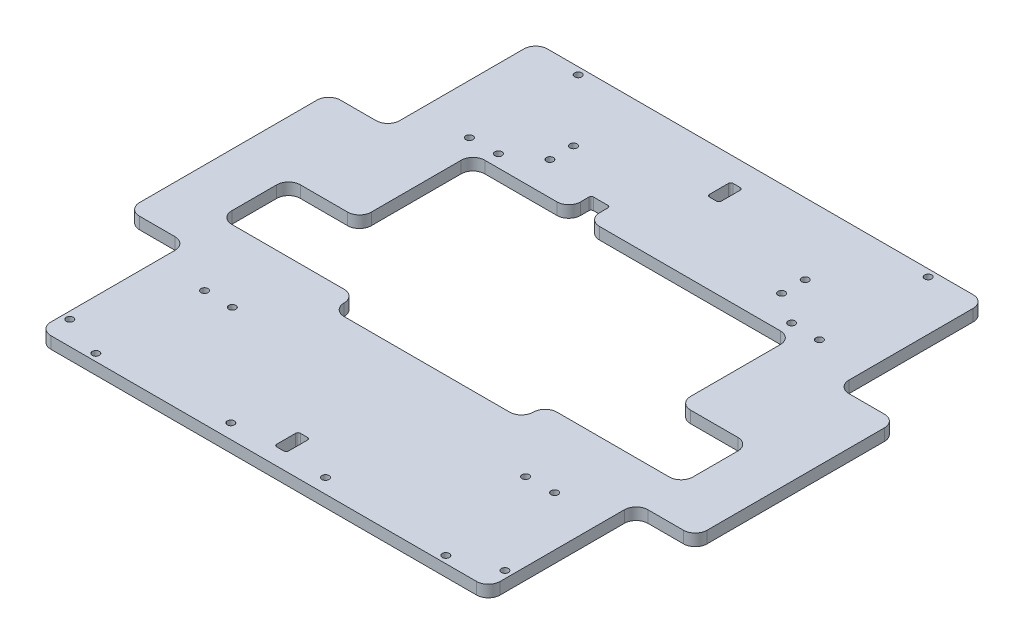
ISO-10303-21;
HEADER;
FILE_DESCRIPTION(('STEP AP214'),'2;1');
FILE_NAME('part.step','',(''),(''),'','','');
FILE_SCHEMA(('AUTOMOTIVE_DESIGN { 1 0 10303 214 1 1 1 1 }'));
ENDSEC;
DATA;
#1=APPLICATION_CONTEXT('core data for automotive mechanical design processes');
#2=APPLICATION_PROTOCOL_DEFINITION('international standard','automotive_design',2000,#1);
#3=PRODUCT_CONTEXT('',#1,'mechanical');
#4=PRODUCT('Part','Part','',(#3));
#5=PRODUCT_RELATED_PRODUCT_CATEGORY('part','',(#4));
#6=PRODUCT_DEFINITION_FORMATION('','',#4);
#7=PRODUCT_DEFINITION_CONTEXT('part definition',#1,'design');
#8=PRODUCT_DEFINITION('design','',#6,#7);
#9=PRODUCT_DEFINITION_SHAPE('','',#8);
#10=(LENGTH_UNIT() NAMED_UNIT(*) SI_UNIT(.MILLI.,.METRE.));
#11=(NAMED_UNIT(*) PLANE_ANGLE_UNIT() SI_UNIT($,.RADIAN.));
#12=(NAMED_UNIT(*) SI_UNIT($,.STERADIAN.) SOLID_ANGLE_UNIT());
#13=UNCERTAINTY_MEASURE_WITH_UNIT(LENGTH_MEASURE(1.E-05),#10,'distance_accuracy_value','');
#14=(GEOMETRIC_REPRESENTATION_CONTEXT(3) GLOBAL_UNCERTAINTY_ASSIGNED_CONTEXT((#13)) GLOBAL_UNIT_ASSIGNED_CONTEXT((#10,
#11,#12)) REPRESENTATION_CONTEXT('',''));
#15=CARTESIAN_POINT('',(0.,0.,0.));
#16=DIRECTION('',(0.,0.,1.));
#17=DIRECTION('',(1.,0.,0.));
#18=AXIS2_PLACEMENT_3D('',#15,#16,#17);
#19=CARTESIAN_POINT('',(-67.5,-5.,26.));
#20=DIRECTION('',(0.,0.,1.));
#21=DIRECTION('',(1.,0.,0.));
#22=AXIS2_PLACEMENT_3D('',#19,#20,#21);
#23=PLANE('',#22);
#24=DIRECTION('',(1.,0.,0.));
#25=VECTOR('',#24,1.);
#26=CARTESIAN_POINT('',(-67.5,5.,26.));
#27=LINE('',#26,#25);
#28=CARTESIAN_POINT('',(45.,5.,26.));
#29=VERTEX_POINT('',#28);
#30=CARTESIAN_POINT('',(92.5,5.,26.));
#31=VERTEX_POINT('',#30);
#32=EDGE_CURVE('E547',#29,#31,#27,.T.);
#33=ORIENTED_EDGE('',*,*,#32,.T.);
#34=DIRECTION('',(0.,1.,0.));
#35=VECTOR('',#34,1.);
#36=CARTESIAN_POINT('',(92.5,0.,26.));
#37=LINE('',#36,#35);
#38=CARTESIAN_POINT('',(92.5,0.,26.));
#39=VERTEX_POINT('',#38);
#40=EDGE_CURVE('E826',#31,#39,#37,.F.);
#41=ORIENTED_EDGE('',*,*,#40,.T.);
#42=DIRECTION('',(1.,0.,0.));
#43=VECTOR('',#42,1.);
#44=CARTESIAN_POINT('',(0.,0.,26.));
#45=LINE('',#44,#43);
#46=CARTESIAN_POINT('',(45.,0.,26.));
#47=VERTEX_POINT('',#46);
#48=EDGE_CURVE('E694',#47,#39,#45,.T.);
#49=ORIENTED_EDGE('',*,*,#48,.F.);
#50=DIRECTION('',(0.,1.,0.));
#51=VECTOR('',#50,1.);
#52=CARTESIAN_POINT('',(45.,-5.,26.));
#53=LINE('',#52,#51);
#54=EDGE_CURVE('E823',#47,#29,#53,.T.);
#55=ORIENTED_EDGE('',*,*,#54,.T.);
#56=EDGE_LOOP('',(#33,#41,#49,#55));
#57=FACE_BOUND('',#56,.T.);
#58=ADVANCED_FACE('F38',(#57),#23,.F.);
#59=CARTESIAN_POINT('',(-67.5,-5.,-51.));
#60=DIRECTION('',(0.,0.,-1.));
#61=DIRECTION('',(-1.,0.,0.));
#62=AXIS2_PLACEMENT_3D('',#59,#60,#61);
#63=PLANE('',#62);
#64=DIRECTION('',(-1.,0.,0.));
#65=VECTOR('',#64,1.);
#66=CARTESIAN_POINT('',(-67.5,5.,-51.));
#67=LINE('',#66,#65);
#68=CARTESIAN_POINT('',(62.5,5.,-51.));
#69=VERTEX_POINT('',#68);
#70=CARTESIAN_POINT('',(-14.,5.,-51.));
#71=VERTEX_POINT('',#70);
#72=EDGE_CURVE('E543',#69,#71,#67,.T.);
#73=ORIENTED_EDGE('',*,*,#72,.T.);
#74=DIRECTION('',(0.,-1.,0.));
#75=VECTOR('',#74,1.);
#76=CARTESIAN_POINT('',(-14.,-5.,-51.));
#77=LINE('',#76,#75);
#78=CARTESIAN_POINT('',(-14.,0.,-51.));
#79=VERTEX_POINT('',#78);
#80=EDGE_CURVE('E738',#71,#79,#77,.T.);
#81=ORIENTED_EDGE('',*,*,#80,.T.);
#82=DIRECTION('',(-1.,0.,0.));
#83=VECTOR('',#82,1.);
#84=CARTESIAN_POINT('',(0.,0.,-51.));
#85=LINE('',#84,#83);
#86=CARTESIAN_POINT('',(62.5,0.,-51.));
#87=VERTEX_POINT('',#86);
#88=EDGE_CURVE('E690',#87,#79,#85,.T.);
#89=ORIENTED_EDGE('',*,*,#88,.F.);
#90=DIRECTION('',(0.,1.,0.));
#91=VECTOR('',#90,1.);
#92=CARTESIAN_POINT('',(62.5,5.,-51.));
#93=LINE('',#92,#91);
#94=EDGE_CURVE('E735',#87,#69,#93,.T.);
#95=ORIENTED_EDGE('',*,*,#94,.T.);
#96=EDGE_LOOP('',(#73,#81,#89,#95));
#97=FACE_BOUND('',#96,.T.);
#98=ADVANCED_FACE('F1220',(#97),#63,.F.);
#99=CARTESIAN_POINT('',(95.,5.,-105.));
#100=DIRECTION('',(-1.,0.,0.));
#101=DIRECTION('',(0.,0.,1.));
#102=AXIS2_PLACEMENT_3D('',#99,#100,#101);
#103=PLANE('',#102);
#104=DIRECTION('',(0.,0.,-1.));
#105=VECTOR('',#104,1.);
#106=CARTESIAN_POINT('',(95.,0.,-105.));
#107=LINE('',#106,#105);
#108=CARTESIAN_POINT('',(95.,0.,-47.5));
#109=VERTEX_POINT('',#108);
#110=CARTESIAN_POINT('',(95.,0.,-100.));
#111=VERTEX_POINT('',#110);
#112=EDGE_CURVE('E619',#109,#111,#107,.T.);
#113=ORIENTED_EDGE('',*,*,#112,.T.);
#114=DIRECTION('',(0.,-1.,0.));
#115=VECTOR('',#114,1.);
#116=CARTESIAN_POINT('',(95.,5.,-100.));
#117=LINE('',#116,#115);
#118=CARTESIAN_POINT('',(95.,5.,-100.));
#119=VERTEX_POINT('',#118);
#120=EDGE_CURVE('E870',#111,#119,#117,.F.);
#121=ORIENTED_EDGE('',*,*,#120,.T.);
#122=DIRECTION('',(0.,0.,-1.));
#123=VECTOR('',#122,1.);
#124=CARTESIAN_POINT('',(95.,5.,-105.));
#125=LINE('',#124,#123);
#126=CARTESIAN_POINT('',(95.,5.,-47.5));
#127=VERTEX_POINT('',#126);
#128=EDGE_CURVE('E627',#127,#119,#125,.T.);
#129=ORIENTED_EDGE('',*,*,#128,.F.);
#130=DIRECTION('',(0.,1.,0.));
#131=VECTOR('',#130,1.);
#132=CARTESIAN_POINT('',(95.,5.,-47.5));
#133=LINE('',#132,#131);
#134=EDGE_CURVE('E868',#127,#109,#133,.F.);
#135=ORIENTED_EDGE('',*,*,#134,.T.);
#136=EDGE_LOOP('',(#113,#121,#129,#135));
#137=FACE_BOUND('',#136,.T.);
#138=ADVANCED_FACE('F1273',(#137),#103,.F.);
#139=CARTESIAN_POINT('',(-95.,5.,-105.));
#140=DIRECTION('',(1.,0.,0.));
#141=DIRECTION('',(0.,0.,-1.));
#142=AXIS2_PLACEMENT_3D('',#139,#140,#141);
#143=PLANE('',#142);
#144=DIRECTION('',(0.,0.,1.));
#145=VECTOR('',#144,1.);
#146=CARTESIAN_POINT('',(-95.,0.,-105.));
#147=LINE('',#146,#145);
#148=CARTESIAN_POINT('',(-95.,0.,47.5));
#149=VERTEX_POINT('',#148);
#150=CARTESIAN_POINT('',(-95.,0.,100.));
#151=VERTEX_POINT('',#150);
#152=EDGE_CURVE('E649',#149,#151,#147,.T.);
#153=ORIENTED_EDGE('',*,*,#152,.T.);
#154=DIRECTION('',(0.,-1.,0.));
#155=VECTOR('',#154,1.);
#156=CARTESIAN_POINT('',(-95.,5.,100.));
#157=LINE('',#156,#155);
#158=CARTESIAN_POINT('',(-95.,5.,100.));
#159=VERTEX_POINT('',#158);
#160=EDGE_CURVE('E900',#151,#159,#157,.F.);
#161=ORIENTED_EDGE('',*,*,#160,.T.);
#162=DIRECTION('',(0.,0.,1.));
#163=VECTOR('',#162,1.);
#164=CARTESIAN_POINT('',(-95.,5.,-105.));
#165=LINE('',#164,#163);
#166=CARTESIAN_POINT('',(-95.,5.,47.5));
#167=VERTEX_POINT('',#166);
#168=EDGE_CURVE('E635',#167,#159,#165,.T.);
#169=ORIENTED_EDGE('',*,*,#168,.F.);
#170=DIRECTION('',(0.,1.,0.));
#171=VECTOR('',#170,1.);
#172=CARTESIAN_POINT('',(-95.,5.,47.5));
#173=LINE('',#172,#171);
#174=EDGE_CURVE('E898',#167,#149,#173,.F.);
#175=ORIENTED_EDGE('',*,*,#174,.T.);
#176=EDGE_LOOP('',(#153,#161,#169,#175));
#177=FACE_BOUND('',#176,.T.);
#178=ADVANCED_FACE('F1373',(#177),#143,.F.);
#179=CARTESIAN_POINT('',(95.,0.,100.));
#180=VERTEX_POINT('',#179);
#181=CARTESIAN_POINT('',(95.,0.,47.5));
#182=VERTEX_POINT('',#181);
#183=EDGE_CURVE('E645',#180,#182,#107,.T.);
#184=ORIENTED_EDGE('',*,*,#183,.T.);
#185=DIRECTION('',(0.,1.,0.));
#186=VECTOR('',#185,1.);
#187=CARTESIAN_POINT('',(95.,5.,47.5));
#188=LINE('',#187,#186);
#189=CARTESIAN_POINT('',(95.,5.,47.5));
#190=VERTEX_POINT('',#189);
#191=EDGE_CURVE('E890',#182,#190,#188,.T.);
#192=ORIENTED_EDGE('',*,*,#191,.T.);
#193=CARTESIAN_POINT('',(95.,5.,100.));
#194=VERTEX_POINT('',#193);
#195=EDGE_CURVE('E630',#194,#190,#125,.T.);
#196=ORIENTED_EDGE('',*,*,#195,.F.);
#197=DIRECTION('',(0.,-1.,0.));
#198=VECTOR('',#197,1.);
#199=CARTESIAN_POINT('',(95.,5.,100.));
#200=LINE('',#199,#198);
#201=EDGE_CURVE('E887',#194,#180,#200,.T.);
#202=ORIENTED_EDGE('',*,*,#201,.T.);
#203=EDGE_LOOP('',(#184,#192,#196,#202));
#204=FACE_BOUND('',#203,.T.);
#205=ADVANCED_FACE('F1376',(#204),#103,.F.);
#206=CARTESIAN_POINT('',(-95.,5.,-105.));
#207=DIRECTION('',(0.,0.,1.));
#208=DIRECTION('',(1.,0.,0.));
#209=AXIS2_PLACEMENT_3D('',#206,#207,#208);
#210=PLANE('',#209);
#211=DIRECTION('',(-1.,0.,0.));
#212=VECTOR('',#211,1.);
#213=CARTESIAN_POINT('',(-95.,0.,-105.));
#214=LINE('',#213,#212);
#215=CARTESIAN_POINT('',(90.,0.,-105.));
#216=VERTEX_POINT('',#215);
#217=CARTESIAN_POINT('',(-90.,0.,-105.));
#218=VERTEX_POINT('',#217);
#219=EDGE_CURVE('E646',#216,#218,#214,.T.);
#220=ORIENTED_EDGE('',*,*,#219,.T.);
#221=DIRECTION('',(0.,-1.,0.));
#222=VECTOR('',#221,1.);
#223=CARTESIAN_POINT('',(-90.,5.,-105.));
#224=LINE('',#223,#222);
#225=CARTESIAN_POINT('',(-90.,5.,-105.));
#226=VERTEX_POINT('',#225);
#227=EDGE_CURVE('E866',#218,#226,#224,.F.);
#228=ORIENTED_EDGE('',*,*,#227,.T.);
#229=DIRECTION('',(-1.,0.,0.));
#230=VECTOR('',#229,1.);
#231=CARTESIAN_POINT('',(-95.,5.,-105.));
#232=LINE('',#231,#230);
#233=CARTESIAN_POINT('',(90.,5.,-105.));
#234=VERTEX_POINT('',#233);
#235=EDGE_CURVE('E632',#234,#226,#232,.T.);
#236=ORIENTED_EDGE('',*,*,#235,.F.);
#237=DIRECTION('',(0.,-1.,0.));
#238=VECTOR('',#237,1.);
#239=CARTESIAN_POINT('',(90.,5.,-105.));
#240=LINE('',#239,#238);
#241=EDGE_CURVE('E863',#234,#216,#240,.T.);
#242=ORIENTED_EDGE('',*,*,#241,.T.);
#243=EDGE_LOOP('',(#220,#228,#236,#242));
#244=FACE_BOUND('',#243,.T.);
#245=ADVANCED_FACE('F1371',(#244),#210,.F.);
#246=CARTESIAN_POINT('',(-95.,0.,-100.));
#247=VERTEX_POINT('',#246);
#248=CARTESIAN_POINT('',(-95.,0.,-47.5));
#249=VERTEX_POINT('',#248);
#250=EDGE_CURVE('E650',#247,#249,#147,.T.);
#251=ORIENTED_EDGE('',*,*,#250,.T.);
#252=DIRECTION('',(0.,1.,0.));
#253=VECTOR('',#252,1.);
#254=CARTESIAN_POINT('',(-95.,5.,-47.5));
#255=LINE('',#254,#253);
#256=CARTESIAN_POINT('',(-95.,5.,-47.5));
#257=VERTEX_POINT('',#256);
#258=EDGE_CURVE('E860',#249,#257,#255,.T.);
#259=ORIENTED_EDGE('',*,*,#258,.T.);
#260=CARTESIAN_POINT('',(-95.,5.,-100.));
#261=VERTEX_POINT('',#260);
#262=EDGE_CURVE('E638',#261,#257,#165,.T.);
#263=ORIENTED_EDGE('',*,*,#262,.F.);
#264=DIRECTION('',(0.,-1.,0.));
#265=VECTOR('',#264,1.);
#266=CARTESIAN_POINT('',(-95.,5.,-100.));
#267=LINE('',#266,#265);
#268=EDGE_CURVE('E857',#261,#247,#267,.T.);
#269=ORIENTED_EDGE('',*,*,#268,.T.);
#270=EDGE_LOOP('',(#251,#259,#263,#269));
#271=FACE_BOUND('',#270,.T.);
#272=ADVANCED_FACE('F1367',(#271),#143,.F.);
#273=CARTESIAN_POINT('',(-95.,5.,105.));
#274=DIRECTION('',(0.,0.,-1.));
#275=DIRECTION('',(-1.,0.,0.));
#276=AXIS2_PLACEMENT_3D('',#273,#274,#275);
#277=PLANE('',#276);
#278=DIRECTION('',(1.,0.,0.));
#279=VECTOR('',#278,1.);
#280=CARTESIAN_POINT('',(-95.,0.,105.));
#281=LINE('',#280,#279);
#282=CARTESIAN_POINT('',(-90.,0.,105.));
#283=VERTEX_POINT('',#282);
#284=CARTESIAN_POINT('',(90.,0.,105.));
#285=VERTEX_POINT('',#284);
#286=EDGE_CURVE('E631',#283,#285,#281,.T.);
#287=ORIENTED_EDGE('',*,*,#286,.T.);
#288=DIRECTION('',(0.,-1.,0.));
#289=VECTOR('',#288,1.);
#290=CARTESIAN_POINT('',(90.,5.,105.));
#291=LINE('',#290,#289);
#292=CARTESIAN_POINT('',(90.,5.,105.));
#293=VERTEX_POINT('',#292);
#294=EDGE_CURVE('E896',#285,#293,#291,.F.);
#295=ORIENTED_EDGE('',*,*,#294,.T.);
#296=DIRECTION('',(1.,0.,0.));
#297=VECTOR('',#296,1.);
#298=CARTESIAN_POINT('',(-95.,5.,105.));
#299=LINE('',#298,#297);
#300=CARTESIAN_POINT('',(-90.,5.,105.));
#301=VERTEX_POINT('',#300);
#302=EDGE_CURVE('E639',#301,#293,#299,.T.);
#303=ORIENTED_EDGE('',*,*,#302,.F.);
#304=DIRECTION('',(0.,-1.,0.));
#305=VECTOR('',#304,1.);
#306=CARTESIAN_POINT('',(-90.,5.,105.));
#307=LINE('',#306,#305);
#308=EDGE_CURVE('E893',#301,#283,#307,.T.);
#309=ORIENTED_EDGE('',*,*,#308,.T.);
#310=EDGE_LOOP('',(#287,#295,#303,#309));
#311=FACE_BOUND('',#310,.T.);
#312=ADVANCED_FACE('F1360',(#311),#277,.F.);
#313=CARTESIAN_POINT('',(0.,5.,0.));
#314=DIRECTION('',(0.,1.,0.));
#315=DIRECTION('',(0.,0.,1.));
#316=AXIS2_PLACEMENT_3D('',#313,#314,#315);
#317=PLANE('',#316);
#318=DIRECTION('',(0.,0.,1.));
#319=VECTOR('',#318,1.);
#320=CARTESIAN_POINT('',(-2.49999999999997,5.,88.));
#321=LINE('',#320,#319);
#322=CARTESIAN_POINT('',(-2.49999999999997,5.,89.));
#323=VERTEX_POINT('',#322);
#324=CARTESIAN_POINT('',(-2.49999999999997,5.,97.));
#325=VERTEX_POINT('',#324);
#326=EDGE_CURVE('E1785',#323,#325,#321,.T.);
#327=ORIENTED_EDGE('',*,*,#326,.F.);
#328=CARTESIAN_POINT('',(-1.49999999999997,5.,89.));
#329=DIRECTION('',(0.,1.,0.));
#330=DIRECTION('',(0.,0.,1.));
#331=AXIS2_PLACEMENT_3D('',#328,#329,#330);
#332=CIRCLE('',#331,1.);
#333=CARTESIAN_POINT('',(-1.49999999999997,5.,88.));
#334=VERTEX_POINT('',#333);
#335=EDGE_CURVE('E1047',#323,#334,#332,.F.);
#336=ORIENTED_EDGE('',*,*,#335,.T.);
#337=DIRECTION('',(-1.,0.,0.));
#338=VECTOR('',#337,1.);
#339=CARTESIAN_POINT('',(2.50000000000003,5.,88.));
#340=LINE('',#339,#338);
#341=CARTESIAN_POINT('',(1.50000000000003,5.,88.));
#342=VERTEX_POINT('',#341);
#343=EDGE_CURVE('E1778',#342,#334,#340,.T.);
#344=ORIENTED_EDGE('',*,*,#343,.F.);
#345=CARTESIAN_POINT('',(1.50000000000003,5.,89.));
#346=DIRECTION('',(0.,1.,0.));
#347=DIRECTION('',(0.,0.,1.));
#348=AXIS2_PLACEMENT_3D('',#345,#346,#347);
#349=CIRCLE('',#348,1.);
#350=CARTESIAN_POINT('',(2.50000000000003,5.,89.));
#351=VERTEX_POINT('',#350);
#352=EDGE_CURVE('E1051',#342,#351,#349,.F.);
#353=ORIENTED_EDGE('',*,*,#352,.T.);
#354=DIRECTION('',(0.,0.,-1.));
#355=VECTOR('',#354,1.);
#356=CARTESIAN_POINT('',(2.50000000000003,5.,88.));
#357=LINE('',#356,#355);
#358=CARTESIAN_POINT('',(2.50000000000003,5.,97.));
#359=VERTEX_POINT('',#358);
#360=EDGE_CURVE('E1796',#359,#351,#357,.T.);
#361=ORIENTED_EDGE('',*,*,#360,.F.);
#362=CARTESIAN_POINT('',(1.50000000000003,5.,97.));
#363=DIRECTION('',(0.,1.,0.));
#364=DIRECTION('',(0.,0.,1.));
#365=AXIS2_PLACEMENT_3D('',#362,#363,#364);
#366=CIRCLE('',#365,1.);
#367=CARTESIAN_POINT('',(1.50000000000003,5.,98.));
#368=VERTEX_POINT('',#367);
#369=EDGE_CURVE('E1039',#359,#368,#366,.F.);
#370=ORIENTED_EDGE('',*,*,#369,.T.);
#371=DIRECTION('',(1.,0.,0.));
#372=VECTOR('',#371,1.);
#373=CARTESIAN_POINT('',(2.50000000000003,5.,98.));
#374=LINE('',#373,#372);
#375=CARTESIAN_POINT('',(-1.49999999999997,5.,98.));
#376=VERTEX_POINT('',#375);
#377=EDGE_CURVE('E1792',#376,#368,#374,.T.);
#378=ORIENTED_EDGE('',*,*,#377,.F.);
#379=CARTESIAN_POINT('',(-1.49999999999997,5.,97.));
#380=DIRECTION('',(0.,1.,0.));
#381=DIRECTION('',(0.,0.,1.));
#382=AXIS2_PLACEMENT_3D('',#379,#380,#381);
#383=CIRCLE('',#382,1.);
#384=EDGE_CURVE('E1043',#376,#325,#383,.F.);
#385=ORIENTED_EDGE('',*,*,#384,.T.);
#386=EDGE_LOOP('',(#327,#336,#344,#353,#361,#370,#378,#385));
#387=FACE_BOUND('',#386,.T.);
#388=DIRECTION('',(0.,0.,1.));
#389=VECTOR('',#388,1.);
#390=CARTESIAN_POINT('',(-2.5,5.,-95.));
#391=LINE('',#390,#389);
#392=CARTESIAN_POINT('',(-2.5,5.,-94.));
#393=VERTEX_POINT('',#392);
#394=CARTESIAN_POINT('',(-2.5,5.,-86.));
#395=VERTEX_POINT('',#394);
#396=EDGE_CURVE('E1071',#393,#395,#391,.T.);
#397=ORIENTED_EDGE('',*,*,#396,.F.);
#398=CARTESIAN_POINT('',(-1.5,5.,-94.));
#399=DIRECTION('',(0.,1.,0.));
#400=DIRECTION('',(0.,0.,1.));
#401=AXIS2_PLACEMENT_3D('',#398,#399,#400);
#402=CIRCLE('',#401,1.);
#403=CARTESIAN_POINT('',(-1.5,5.,-95.));
#404=VERTEX_POINT('',#403);
#405=EDGE_CURVE('E46',#393,#404,#402,.F.);
#406=ORIENTED_EDGE('',*,*,#405,.T.);
#407=DIRECTION('',(-1.,0.,0.));
#408=VECTOR('',#407,1.);
#409=CARTESIAN_POINT('',(2.5,5.,-95.));
#410=LINE('',#409,#408);
#411=CARTESIAN_POINT('',(1.5,5.,-95.));
#412=VERTEX_POINT('',#411);
#413=EDGE_CURVE('E1069',#412,#404,#410,.T.);
#414=ORIENTED_EDGE('',*,*,#413,.F.);
#415=CARTESIAN_POINT('',(1.5,5.,-94.));
#416=DIRECTION('',(0.,1.,0.));
#417=DIRECTION('',(0.,0.,1.));
#418=AXIS2_PLACEMENT_3D('',#415,#416,#417);
#419=CIRCLE('',#418,1.);
#420=CARTESIAN_POINT('',(2.5,5.,-94.));
#421=VERTEX_POINT('',#420);
#422=EDGE_CURVE('E1063',#412,#421,#419,.F.);
#423=ORIENTED_EDGE('',*,*,#422,.T.);
#424=DIRECTION('',(0.,0.,-1.));
#425=VECTOR('',#424,1.);
#426=CARTESIAN_POINT('',(2.5,5.,-95.));
#427=LINE('',#426,#425);
#428=CARTESIAN_POINT('',(2.5,5.,-86.));
#429=VERTEX_POINT('',#428);
#430=EDGE_CURVE('E1077',#429,#421,#427,.T.);
#431=ORIENTED_EDGE('',*,*,#430,.F.);
#432=CARTESIAN_POINT('',(1.5,5.,-86.));
#433=DIRECTION('',(0.,1.,0.));
#434=DIRECTION('',(0.,0.,1.));
#435=AXIS2_PLACEMENT_3D('',#432,#433,#434);
#436=CIRCLE('',#435,1.);
#437=CARTESIAN_POINT('',(1.5,5.,-85.));
#438=VERTEX_POINT('',#437);
#439=EDGE_CURVE('E1059',#429,#438,#436,.F.);
#440=ORIENTED_EDGE('',*,*,#439,.T.);
#441=DIRECTION('',(1.,0.,0.));
#442=VECTOR('',#441,1.);
#443=CARTESIAN_POINT('',(2.5,5.,-85.));
#444=LINE('',#443,#442);
#445=CARTESIAN_POINT('',(-1.5,5.,-85.));
#446=VERTEX_POINT('',#445);
#447=EDGE_CURVE('E1097',#446,#438,#444,.T.);
#448=ORIENTED_EDGE('',*,*,#447,.F.);
#449=CARTESIAN_POINT('',(-1.5,5.,-86.));
#450=DIRECTION('',(0.,1.,0.));
#451=DIRECTION('',(0.,0.,1.));
#452=AXIS2_PLACEMENT_3D('',#449,#450,#451);
#453=CIRCLE('',#452,1.);
#454=EDGE_CURVE('E1055',#446,#395,#453,.F.);
#455=ORIENTED_EDGE('',*,*,#454,.T.);
#456=EDGE_LOOP('',(#397,#406,#414,#423,#431,#440,#448,#455));
#457=FACE_BOUND('',#456,.T.);
#458=CARTESIAN_POINT('',(-49.,5.,-75.));
#459=DIRECTION('',(0.,1.,0.));
#460=DIRECTION('',(0.,0.,1.));
#461=AXIS2_PLACEMENT_3D('',#458,#459,#460);
#462=CIRCLE('',#461,1.5);
#463=CARTESIAN_POINT('',(-49.,5.,-73.5));
#464=VERTEX_POINT('',#463);
#465=EDGE_CURVE('E973',#464,#464,#462,.T.);
#466=ORIENTED_EDGE('',*,*,#465,.F.);
#467=EDGE_LOOP('',(#466));
#468=FACE_BOUND('',#467,.T.);
#469=CARTESIAN_POINT('',(49.,5.,-75.));
#470=DIRECTION('',(0.,1.,0.));
#471=DIRECTION('',(0.,0.,-1.));
#472=AXIS2_PLACEMENT_3D('',#469,#470,#471);
#473=CIRCLE('',#472,1.5);
#474=CARTESIAN_POINT('',(49.,5.,-76.5));
#475=VERTEX_POINT('',#474);
#476=EDGE_CURVE('E1115',#475,#475,#473,.T.);
#477=ORIENTED_EDGE('',*,*,#476,.F.);
#478=EDGE_LOOP('',(#477));
#479=FACE_BOUND('',#478,.T.);
#480=CARTESIAN_POINT('',(49.,5.,-65.));
#481=DIRECTION('',(0.,1.,0.));
#482=DIRECTION('',(0.,0.,-1.));
#483=AXIS2_PLACEMENT_3D('',#480,#481,#482);
#484=CIRCLE('',#483,1.5);
#485=CARTESIAN_POINT('',(49.,5.,-66.5));
#486=VERTEX_POINT('',#485);
#487=EDGE_CURVE('E1076',#486,#486,#484,.T.);
#488=ORIENTED_EDGE('',*,*,#487,.F.);
#489=EDGE_LOOP('',(#488));
#490=FACE_BOUND('',#489,.T.);
#491=CARTESIAN_POINT('',(-49.,5.,-65.));
#492=DIRECTION('',(0.,1.,0.));
#493=DIRECTION('',(0.,0.,1.));
#494=AXIS2_PLACEMENT_3D('',#491,#492,#493);
#495=CIRCLE('',#494,1.5);
#496=CARTESIAN_POINT('',(-49.,5.,-63.5));
#497=VERTEX_POINT('',#496);
#498=EDGE_CURVE('E968',#497,#497,#495,.T.);
#499=ORIENTED_EDGE('',*,*,#498,.F.);
#500=EDGE_LOOP('',(#499));
#501=FACE_BOUND('',#500,.T.);
#502=CARTESIAN_POINT('',(20.,5.,98.9));
#503=DIRECTION('',(0.,1.,0.));
#504=DIRECTION('',(0.,0.,-1.));
#505=AXIS2_PLACEMENT_3D('',#502,#503,#504);
#506=CIRCLE('',#505,1.5);
#507=CARTESIAN_POINT('',(20.,5.,97.4));
#508=VERTEX_POINT('',#507);
#509=EDGE_CURVE('E726',#508,#508,#506,.T.);
#510=ORIENTED_EDGE('',*,*,#509,.F.);
#511=EDGE_LOOP('',(#510));
#512=FACE_BOUND('',#511,.T.);
#513=CARTESIAN_POINT('',(-20.,5.,98.9));
#514=DIRECTION('',(0.,1.,0.));
#515=DIRECTION('',(0.,0.,1.));
#516=AXIS2_PLACEMENT_3D('',#513,#514,#515);
#517=CIRCLE('',#516,1.5);
#518=CARTESIAN_POINT('',(-20.,5.,100.4));
#519=VERTEX_POINT('',#518);
#520=EDGE_CURVE('E722',#519,#519,#517,.T.);
#521=ORIENTED_EDGE('',*,*,#520,.F.);
#522=EDGE_LOOP('',(#521));
#523=FACE_BOUND('',#522,.T.);
#524=CARTESIAN_POINT('',(92.,5.,95.));
#525=DIRECTION('',(0.,1.,0.));
#526=DIRECTION('',(0.,0.,-1.));
#527=AXIS2_PLACEMENT_3D('',#524,#525,#526);
#528=CIRCLE('',#527,1.5);
#529=CARTESIAN_POINT('',(92.,5.,93.5));
#530=VERTEX_POINT('',#529);
#531=EDGE_CURVE('E718',#530,#530,#528,.T.);
#532=ORIENTED_EDGE('',*,*,#531,.F.);
#533=EDGE_LOOP('',(#532));
#534=FACE_BOUND('',#533,.T.);
#535=CARTESIAN_POINT('',(-92.,5.,95.));
#536=DIRECTION('',(0.,1.,0.));
#537=DIRECTION('',(0.,0.,1.));
#538=AXIS2_PLACEMENT_3D('',#535,#536,#537);
#539=CIRCLE('',#538,1.5);
#540=CARTESIAN_POINT('',(-92.,5.,96.5));
#541=VERTEX_POINT('',#540);
#542=EDGE_CURVE('E714',#541,#541,#539,.T.);
#543=ORIENTED_EDGE('',*,*,#542,.F.);
#544=EDGE_LOOP('',(#543));
#545=FACE_BOUND('',#544,.T.);
#546=DIRECTION('',(0.,0.,-1.));
#547=VECTOR('',#546,1.);
#548=CARTESIAN_POINT('',(-19.,5.,-60.5027322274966));
#549=LINE('',#548,#547);
#550=CARTESIAN_POINT('',(-19.,5.,-56.));
#551=VERTEX_POINT('',#550);
#552=CARTESIAN_POINT('',(-19.,5.,-59.5027322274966));
#553=VERTEX_POINT('',#552);
#554=EDGE_CURVE('E505',#551,#553,#549,.T.);
#555=ORIENTED_EDGE('',*,*,#554,.F.);
#556=CARTESIAN_POINT('',(-14.,5.,-56.));
#557=DIRECTION('',(0.,1.,0.));
#558=DIRECTION('',(0.,0.,1.));
#559=AXIS2_PLACEMENT_3D('',#556,#557,#558);
#560=CIRCLE('',#559,5.);
#561=EDGE_CURVE('E795',#551,#71,#560,.T.);
#562=ORIENTED_EDGE('',*,*,#561,.T.);
#563=ORIENTED_EDGE('',*,*,#72,.F.);
#564=CARTESIAN_POINT('',(62.5,5.,-46.));
#565=DIRECTION('',(0.,1.,0.));
#566=DIRECTION('',(0.,0.,1.));
#567=AXIS2_PLACEMENT_3D('',#564,#565,#566);
#568=CIRCLE('',#567,5.);
#569=CARTESIAN_POINT('',(67.5,5.,-46.));
#570=VERTEX_POINT('',#569);
#571=EDGE_CURVE('E914',#69,#570,#568,.F.);
#572=ORIENTED_EDGE('',*,*,#571,.T.);
#573=DIRECTION('',(0.,0.,-1.));
#574=VECTOR('',#573,1.);
#575=CARTESIAN_POINT('',(67.5,5.,-51.));
#576=LINE('',#575,#574);
#577=CARTESIAN_POINT('',(67.5,5.,-8.00000000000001));
#578=VERTEX_POINT('',#577);
#579=EDGE_CURVE('E537',#578,#570,#576,.T.);
#580=ORIENTED_EDGE('',*,*,#579,.F.);
#581=CARTESIAN_POINT('',(72.5,5.,-7.99999999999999));
#582=DIRECTION('',(0.,1.,0.));
#583=DIRECTION('',(0.,0.,1.));
#584=AXIS2_PLACEMENT_3D('',#581,#582,#583);
#585=CIRCLE('',#584,5.);
#586=CARTESIAN_POINT('',(72.5,5.,-2.99999999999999));
#587=VERTEX_POINT('',#586);
#588=EDGE_CURVE('E791',#578,#587,#585,.T.);
#589=ORIENTED_EDGE('',*,*,#588,.T.);
#590=DIRECTION('',(-1.,0.,0.));
#591=VECTOR('',#590,1.);
#592=CARTESIAN_POINT('',(67.5,5.,-2.99999999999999));
#593=LINE('',#592,#591);
#594=CARTESIAN_POINT('',(92.5,5.,-2.99999999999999));
#595=VERTEX_POINT('',#594);
#596=EDGE_CURVE('E522',#595,#587,#593,.T.);
#597=ORIENTED_EDGE('',*,*,#596,.F.);
#598=CARTESIAN_POINT('',(92.5,5.,2.00000000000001));
#599=DIRECTION('',(0.,1.,0.));
#600=DIRECTION('',(0.,0.,1.));
#601=AXIS2_PLACEMENT_3D('',#598,#599,#600);
#602=CIRCLE('',#601,5.);
#603=CARTESIAN_POINT('',(97.5,5.,2.00000000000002));
#604=VERTEX_POINT('',#603);
#605=EDGE_CURVE('E918',#595,#604,#602,.F.);
#606=ORIENTED_EDGE('',*,*,#605,.T.);
#607=DIRECTION('',(0.,0.,-1.));
#608=VECTOR('',#607,1.);
#609=CARTESIAN_POINT('',(97.5,5.,26.));
#610=LINE('',#609,#608);
#611=CARTESIAN_POINT('',(97.5,5.,21.));
#612=VERTEX_POINT('',#611);
#613=EDGE_CURVE('E519',#612,#604,#610,.T.);
#614=ORIENTED_EDGE('',*,*,#613,.F.);
#615=CARTESIAN_POINT('',(92.5,5.,21.));
#616=DIRECTION('',(0.,1.,0.));
#617=DIRECTION('',(0.,0.,1.));
#618=AXIS2_PLACEMENT_3D('',#615,#616,#617);
#619=CIRCLE('',#618,5.);
#620=EDGE_CURVE('E922',#612,#31,#619,.F.);
#621=ORIENTED_EDGE('',*,*,#620,.T.);
#622=ORIENTED_EDGE('',*,*,#32,.F.);
#623=CARTESIAN_POINT('',(45.,5.,31.));
#624=DIRECTION('',(0.,1.,0.));
#625=DIRECTION('',(0.,0.,1.));
#626=AXIS2_PLACEMENT_3D('',#623,#624,#625);
#627=CIRCLE('',#626,5.);
#628=CARTESIAN_POINT('',(40.,5.,31.));
#629=VERTEX_POINT('',#628);
#630=EDGE_CURVE('E789',#29,#629,#627,.T.);
#631=ORIENTED_EDGE('',*,*,#630,.T.);
#632=CARTESIAN_POINT('',(35.,5.,31.));
#633=DIRECTION('',(0.,1.,0.));
#634=DIRECTION('',(0.,0.,1.));
#635=AXIS2_PLACEMENT_3D('',#632,#633,#634);
#636=CIRCLE('',#635,5.);
#637=CARTESIAN_POINT('',(35.,5.,36.));
#638=VERTEX_POINT('',#637);
#639=EDGE_CURVE('E926',#629,#638,#636,.F.);
#640=ORIENTED_EDGE('',*,*,#639,.T.);
#641=DIRECTION('',(1.,0.,0.));
#642=VECTOR('',#641,1.);
#643=CARTESIAN_POINT('',(-40.,5.,36.));
#644=LINE('',#643,#642);
#645=CARTESIAN_POINT('',(-35.,5.,36.));
#646=VERTEX_POINT('',#645);
#647=EDGE_CURVE('E510',#646,#638,#644,.T.);
#648=ORIENTED_EDGE('',*,*,#647,.F.);
#649=CARTESIAN_POINT('',(-35.,5.,31.));
#650=DIRECTION('',(0.,1.,0.));
#651=DIRECTION('',(0.,0.,1.));
#652=AXIS2_PLACEMENT_3D('',#649,#650,#651);
#653=CIRCLE('',#652,5.);
#654=CARTESIAN_POINT('',(-40.,5.,31.));
#655=VERTEX_POINT('',#654);
#656=EDGE_CURVE('E930',#646,#655,#653,.F.);
#657=ORIENTED_EDGE('',*,*,#656,.T.);
#658=CARTESIAN_POINT('',(-45.,5.,31.));
#659=DIRECTION('',(0.,1.,0.));
#660=DIRECTION('',(0.,0.,1.));
#661=AXIS2_PLACEMENT_3D('',#658,#659,#660);
#662=CIRCLE('',#661,5.);
#663=CARTESIAN_POINT('',(-45.,5.,26.));
#664=VERTEX_POINT('',#663);
#665=EDGE_CURVE('E787',#655,#664,#662,.T.);
#666=ORIENTED_EDGE('',*,*,#665,.T.);
#667=CARTESIAN_POINT('',(-92.5,5.,26.));
#668=VERTEX_POINT('',#667);
#669=EDGE_CURVE('E550',#668,#664,#27,.T.);
#670=ORIENTED_EDGE('',*,*,#669,.F.);
#671=CARTESIAN_POINT('',(-92.5,5.,21.));
#672=DIRECTION('',(0.,1.,0.));
#673=DIRECTION('',(0.,0.,1.));
#674=AXIS2_PLACEMENT_3D('',#671,#672,#673);
#675=CIRCLE('',#674,5.);
#676=CARTESIAN_POINT('',(-97.5,5.,21.));
#677=VERTEX_POINT('',#676);
#678=EDGE_CURVE('E934',#668,#677,#675,.F.);
#679=ORIENTED_EDGE('',*,*,#678,.T.);
#680=DIRECTION('',(0.,0.,1.));
#681=VECTOR('',#680,1.);
#682=CARTESIAN_POINT('',(-97.5,5.,26.));
#683=LINE('',#682,#681);
#684=CARTESIAN_POINT('',(-97.5,5.,2.00000000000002));
#685=VERTEX_POINT('',#684);
#686=EDGE_CURVE('E531',#685,#677,#683,.T.);
#687=ORIENTED_EDGE('',*,*,#686,.F.);
#688=CARTESIAN_POINT('',(-92.5,5.,2.00000000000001));
#689=DIRECTION('',(0.,1.,0.));
#690=DIRECTION('',(0.,0.,1.));
#691=AXIS2_PLACEMENT_3D('',#688,#689,#690);
#692=CIRCLE('',#691,5.);
#693=CARTESIAN_POINT('',(-92.5,5.,-2.99999999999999));
#694=VERTEX_POINT('',#693);
#695=EDGE_CURVE('E938',#685,#694,#692,.F.);
#696=ORIENTED_EDGE('',*,*,#695,.T.);
#697=DIRECTION('',(-1.,0.,0.));
#698=VECTOR('',#697,1.);
#699=CARTESIAN_POINT('',(-67.5,5.,-2.99999999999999));
#700=LINE('',#699,#698);
#701=CARTESIAN_POINT('',(-72.5,5.,-2.99999999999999));
#702=VERTEX_POINT('',#701);
#703=EDGE_CURVE('E528',#702,#694,#700,.T.);
#704=ORIENTED_EDGE('',*,*,#703,.F.);
#705=CARTESIAN_POINT('',(-72.5,5.,-7.99999999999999));
#706=DIRECTION('',(0.,1.,0.));
#707=DIRECTION('',(0.,0.,1.));
#708=AXIS2_PLACEMENT_3D('',#705,#706,#707);
#709=CIRCLE('',#708,5.);
#710=CARTESIAN_POINT('',(-67.5,5.,-8.00000000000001));
#711=VERTEX_POINT('',#710);
#712=EDGE_CURVE('E785',#702,#711,#709,.T.);
#713=ORIENTED_EDGE('',*,*,#712,.T.);
#714=DIRECTION('',(0.,0.,1.));
#715=VECTOR('',#714,1.);
#716=CARTESIAN_POINT('',(-67.5,5.,-51.));
#717=LINE('',#716,#715);
#718=CARTESIAN_POINT('',(-67.5,5.,-46.));
#719=VERTEX_POINT('',#718);
#720=EDGE_CURVE('E544',#719,#711,#717,.T.);
#721=ORIENTED_EDGE('',*,*,#720,.F.);
#722=CARTESIAN_POINT('',(-62.5,5.,-46.));
#723=DIRECTION('',(0.,1.,0.));
#724=DIRECTION('',(0.,0.,1.));
#725=AXIS2_PLACEMENT_3D('',#722,#723,#724);
#726=CIRCLE('',#725,5.);
#727=CARTESIAN_POINT('',(-62.5,5.,-51.));
#728=VERTEX_POINT('',#727);
#729=EDGE_CURVE('E910',#719,#728,#726,.F.);
#730=ORIENTED_EDGE('',*,*,#729,.T.);
#731=CARTESIAN_POINT('',(-32.,5.,-51.));
#732=VERTEX_POINT('',#731);
#733=EDGE_CURVE('E540',#732,#728,#67,.T.);
#734=ORIENTED_EDGE('',*,*,#733,.F.);
#735=CARTESIAN_POINT('',(-32.,5.,-56.));
#736=DIRECTION('',(0.,1.,0.));
#737=DIRECTION('',(0.,0.,1.));
#738=AXIS2_PLACEMENT_3D('',#735,#736,#737);
#739=CIRCLE('',#738,5.);
#740=CARTESIAN_POINT('',(-27.,5.,-56.));
#741=VERTEX_POINT('',#740);
#742=EDGE_CURVE('E793',#732,#741,#739,.T.);
#743=ORIENTED_EDGE('',*,*,#742,.T.);
#744=DIRECTION('',(0.,0.,1.));
#745=VECTOR('',#744,1.);
#746=CARTESIAN_POINT('',(-27.,5.,-60.5027322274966));
#747=LINE('',#746,#745);
#748=CARTESIAN_POINT('',(-27.,5.,-59.5027322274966));
#749=VERTEX_POINT('',#748);
#750=EDGE_CURVE('E504',#749,#741,#747,.T.);
#751=ORIENTED_EDGE('',*,*,#750,.F.);
#752=CARTESIAN_POINT('',(-26.,5.,-59.5027322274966));
#753=DIRECTION('',(0.,1.,0.));
#754=DIRECTION('',(0.,0.,1.));
#755=AXIS2_PLACEMENT_3D('',#752,#753,#754);
#756=CIRCLE('',#755,1.);
#757=CARTESIAN_POINT('',(-26.,5.,-60.5027322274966));
#758=VERTEX_POINT('',#757);
#759=EDGE_CURVE('E503',#749,#758,#756,.F.);
#760=ORIENTED_EDGE('',*,*,#759,.T.);
#761=DIRECTION('',(-1.,0.,0.));
#762=VECTOR('',#761,1.);
#763=CARTESIAN_POINT('',(-27.,5.,-60.5027322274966));
#764=LINE('',#763,#762);
#765=CARTESIAN_POINT('',(-20.,5.,-60.5027322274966));
#766=VERTEX_POINT('',#765);
#767=EDGE_CURVE('E493',#766,#758,#764,.T.);
#768=ORIENTED_EDGE('',*,*,#767,.F.);
#769=CARTESIAN_POINT('',(-20.,5.,-59.5027322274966));
#770=DIRECTION('',(0.,1.,0.));
#771=DIRECTION('',(0.,0.,1.));
#772=AXIS2_PLACEMENT_3D('',#769,#770,#771);
#773=CIRCLE('',#772,1.);
#774=EDGE_CURVE('E476',#766,#553,#773,.F.);
#775=ORIENTED_EDGE('',*,*,#774,.T.);
#776=EDGE_LOOP('',(#555,#562,#563,#572,#580,#589,#597,#606,#614,#621,#622,#631,#640,#648,#657,
#666,#670,#679,#687,#696,#704,#713,#721,#730,#734,#743,#751,#760,#768,#775));
#777=FACE_BOUND('',#776,.T.);
#778=CARTESIAN_POINT('',(-74.,5.,56.));
#779=DIRECTION('',(0.,1.,0.));
#780=DIRECTION('',(0.,0.,1.));
#781=AXIS2_PLACEMENT_3D('',#778,#779,#780);
#782=CIRCLE('',#781,1.5);
#783=CARTESIAN_POINT('',(-74.,5.,57.5));
#784=VERTEX_POINT('',#783);
#785=EDGE_CURVE('E551',#784,#784,#782,.T.);
#786=ORIENTED_EDGE('',*,*,#785,.F.);
#787=EDGE_LOOP('',(#786));
#788=FACE_BOUND('',#787,.T.);
#789=CARTESIAN_POINT('',(-62.,5.,56.2735525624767));
#790=DIRECTION('',(0.,1.,0.));
#791=DIRECTION('',(0.,0.,1.));
#792=AXIS2_PLACEMENT_3D('',#789,#790,#791);
#793=CIRCLE('',#792,1.5);
#794=CARTESIAN_POINT('',(-62.,5.,57.7735525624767));
#795=VERTEX_POINT('',#794);
#796=EDGE_CURVE('E555',#795,#795,#793,.T.);
#797=ORIENTED_EDGE('',*,*,#796,.F.);
#798=EDGE_LOOP('',(#797));
#799=FACE_BOUND('',#798,.T.);
#800=CARTESIAN_POINT('',(62.,5.,56.2735525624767));
#801=DIRECTION('',(0.,1.,0.));
#802=DIRECTION('',(0.,0.,-1.));
#803=AXIS2_PLACEMENT_3D('',#800,#801,#802);
#804=CIRCLE('',#803,1.5);
#805=CARTESIAN_POINT('',(62.,5.,54.7735525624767));
#806=VERTEX_POINT('',#805);
#807=EDGE_CURVE('E558',#806,#806,#804,.T.);
#808=ORIENTED_EDGE('',*,*,#807,.F.);
#809=EDGE_LOOP('',(#808));
#810=FACE_BOUND('',#809,.T.);
#811=CARTESIAN_POINT('',(74.,5.,56.));
#812=DIRECTION('',(0.,1.,0.));
#813=DIRECTION('',(0.,0.,-1.));
#814=AXIS2_PLACEMENT_3D('',#811,#812,#813);
#815=CIRCLE('',#814,1.5);
#816=CARTESIAN_POINT('',(74.,5.,54.5));
#817=VERTEX_POINT('',#816);
#818=EDGE_CURVE('E561',#817,#817,#815,.T.);
#819=ORIENTED_EDGE('',*,*,#818,.F.);
#820=EDGE_LOOP('',(#819));
#821=FACE_BOUND('',#820,.T.);
#822=CARTESIAN_POINT('',(74.,5.,102.));
#823=DIRECTION('',(0.,1.,0.));
#824=DIRECTION('',(0.,0.,-1.));
#825=AXIS2_PLACEMENT_3D('',#822,#823,#824);
#826=CIRCLE('',#825,1.5);
#827=CARTESIAN_POINT('',(74.,5.,100.5));
#828=VERTEX_POINT('',#827);
#829=EDGE_CURVE('E564',#828,#828,#826,.T.);
#830=ORIENTED_EDGE('',*,*,#829,.F.);
#831=EDGE_LOOP('',(#830));
#832=FACE_BOUND('',#831,.T.);
#833=CARTESIAN_POINT('',(74.,5.,-102.));
#834=DIRECTION('',(0.,1.,0.));
#835=DIRECTION('',(0.,0.,1.));
#836=AXIS2_PLACEMENT_3D('',#833,#834,#835);
#837=CIRCLE('',#836,1.5);
#838=CARTESIAN_POINT('',(74.,5.,-100.5));
#839=VERTEX_POINT('',#838);
#840=EDGE_CURVE('E567',#839,#839,#837,.T.);
#841=ORIENTED_EDGE('',*,*,#840,.F.);
#842=EDGE_LOOP('',(#841));
#843=FACE_BOUND('',#842,.T.);
#844=CARTESIAN_POINT('',(74.,5.,-56.));
#845=DIRECTION('',(0.,1.,0.));
#846=DIRECTION('',(0.,0.,1.));
#847=AXIS2_PLACEMENT_3D('',#844,#845,#846);
#848=CIRCLE('',#847,1.5);
#849=CARTESIAN_POINT('',(74.,5.,-54.5));
#850=VERTEX_POINT('',#849);
#851=EDGE_CURVE('E570',#850,#850,#848,.T.);
#852=ORIENTED_EDGE('',*,*,#851,.F.);
#853=EDGE_LOOP('',(#852));
#854=FACE_BOUND('',#853,.T.);
#855=CARTESIAN_POINT('',(62.,5.,-56.2735525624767));
#856=DIRECTION('',(0.,1.,0.));
#857=DIRECTION('',(0.,0.,1.));
#858=AXIS2_PLACEMENT_3D('',#855,#856,#857);
#859=CIRCLE('',#858,1.5);
#860=CARTESIAN_POINT('',(62.,5.,-54.7735525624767));
#861=VERTEX_POINT('',#860);
#862=EDGE_CURVE('E573',#861,#861,#859,.T.);
#863=ORIENTED_EDGE('',*,*,#862,.F.);
#864=EDGE_LOOP('',(#863));
#865=FACE_BOUND('',#864,.T.);
#866=CARTESIAN_POINT('',(-62.,5.,-56.2735525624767));
#867=DIRECTION('',(0.,1.,0.));
#868=DIRECTION('',(0.,0.,-1.));
#869=AXIS2_PLACEMENT_3D('',#866,#867,#868);
#870=CIRCLE('',#869,1.5);
#871=CARTESIAN_POINT('',(-62.,5.,-57.7735525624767));
#872=VERTEX_POINT('',#871);
#873=EDGE_CURVE('E576',#872,#872,#870,.T.);
#874=ORIENTED_EDGE('',*,*,#873,.F.);
#875=EDGE_LOOP('',(#874));
#876=FACE_BOUND('',#875,.T.);
#877=CARTESIAN_POINT('',(-74.,5.,-56.));
#878=DIRECTION('',(0.,1.,0.));
#879=DIRECTION('',(0.,0.,-1.));
#880=AXIS2_PLACEMENT_3D('',#877,#878,#879);
#881=CIRCLE('',#880,1.5);
#882=CARTESIAN_POINT('',(-74.,5.,-57.5));
#883=VERTEX_POINT('',#882);
#884=EDGE_CURVE('E579',#883,#883,#881,.T.);
#885=ORIENTED_EDGE('',*,*,#884,.F.);
#886=EDGE_LOOP('',(#885));
#887=FACE_BOUND('',#886,.T.);
#888=CARTESIAN_POINT('',(-74.,5.,-102.));
#889=DIRECTION('',(0.,1.,0.));
#890=DIRECTION('',(0.,0.,-1.));
#891=AXIS2_PLACEMENT_3D('',#888,#889,#890);
#892=CIRCLE('',#891,1.5);
#893=CARTESIAN_POINT('',(-74.,5.,-103.5));
#894=VERTEX_POINT('',#893);
#895=EDGE_CURVE('E582',#894,#894,#892,.T.);
#896=ORIENTED_EDGE('',*,*,#895,.F.);
#897=EDGE_LOOP('',(#896));
#898=FACE_BOUND('',#897,.T.);
#899=CARTESIAN_POINT('',(-74.,5.,102.));
#900=DIRECTION('',(0.,1.,0.));
#901=DIRECTION('',(0.,0.,1.));
#902=AXIS2_PLACEMENT_3D('',#899,#900,#901);
#903=CIRCLE('',#902,1.5);
#904=CARTESIAN_POINT('',(-74.,5.,103.5));
#905=VERTEX_POINT('',#904);
#906=EDGE_CURVE('E585',#905,#905,#903,.T.);
#907=ORIENTED_EDGE('',*,*,#906,.F.);
#908=EDGE_LOOP('',(#907));
#909=FACE_BOUND('',#908,.T.);
#910=DIRECTION('',(-1.,0.,0.));
#911=VECTOR('',#910,1.);
#912=CARTESIAN_POINT('',(-95.,5.,-42.5));
#913=LINE('',#912,#911);
#914=CARTESIAN_POINT('',(-100.,5.,-42.5));
#915=VERTEX_POINT('',#914);
#916=CARTESIAN_POINT('',(-115.,5.,-42.5));
#917=VERTEX_POINT('',#916);
#918=EDGE_CURVE('E600',#915,#917,#913,.T.);
#919=ORIENTED_EDGE('',*,*,#918,.T.);
#920=CARTESIAN_POINT('',(-115.,5.,-37.5));
#921=DIRECTION('',(0.,1.,0.));
#922=DIRECTION('',(0.,0.,1.));
#923=AXIS2_PLACEMENT_3D('',#920,#921,#922);
#924=CIRCLE('',#923,5.);
#925=CARTESIAN_POINT('',(-120.,5.,-37.5));
#926=VERTEX_POINT('',#925);
#927=EDGE_CURVE('E783',#917,#926,#924,.T.);
#928=ORIENTED_EDGE('',*,*,#927,.T.);
#929=DIRECTION('',(0.,0.,1.));
#930=VECTOR('',#929,1.);
#931=CARTESIAN_POINT('',(-120.,5.,-42.5));
#932=LINE('',#931,#930);
#933=CARTESIAN_POINT('',(-120.,5.,37.5));
#934=VERTEX_POINT('',#933);
#935=EDGE_CURVE('E622',#926,#934,#932,.T.);
#936=ORIENTED_EDGE('',*,*,#935,.T.);
#937=CARTESIAN_POINT('',(-115.,5.,37.5));
#938=DIRECTION('',(0.,1.,0.));
#939=DIRECTION('',(0.,0.,1.));
#940=AXIS2_PLACEMENT_3D('',#937,#938,#939);
#941=CIRCLE('',#940,5.);
#942=CARTESIAN_POINT('',(-115.,5.,42.5));
#943=VERTEX_POINT('',#942);
#944=EDGE_CURVE('E769',#934,#943,#941,.T.);
#945=ORIENTED_EDGE('',*,*,#944,.T.);
#946=DIRECTION('',(1.,0.,0.));
#947=VECTOR('',#946,1.);
#948=CARTESIAN_POINT('',(-95.,5.,42.5));
#949=LINE('',#948,#947);
#950=CARTESIAN_POINT('',(-100.,5.,42.5));
#951=VERTEX_POINT('',#950);
#952=EDGE_CURVE('E613',#943,#951,#949,.T.);
#953=ORIENTED_EDGE('',*,*,#952,.T.);
#954=CARTESIAN_POINT('',(-100.,5.,47.5));
#955=DIRECTION('',(0.,1.,0.));
#956=DIRECTION('',(0.,0.,1.));
#957=AXIS2_PLACEMENT_3D('',#954,#955,#956);
#958=CIRCLE('',#957,5.);
#959=EDGE_CURVE('E954',#951,#167,#958,.F.);
#960=ORIENTED_EDGE('',*,*,#959,.T.);
#961=ORIENTED_EDGE('',*,*,#168,.T.);
#962=CARTESIAN_POINT('',(-90.,5.,100.));
#963=DIRECTION('',(0.,1.,0.));
#964=DIRECTION('',(0.,0.,1.));
#965=AXIS2_PLACEMENT_3D('',#962,#963,#964);
#966=CIRCLE('',#965,5.);
#967=EDGE_CURVE('E771',#159,#301,#966,.T.);
#968=ORIENTED_EDGE('',*,*,#967,.T.);
#969=ORIENTED_EDGE('',*,*,#302,.T.);
#970=CARTESIAN_POINT('',(90.,5.,100.));
#971=DIRECTION('',(0.,1.,0.));
#972=DIRECTION('',(0.,0.,1.));
#973=AXIS2_PLACEMENT_3D('',#970,#971,#972);
#974=CIRCLE('',#973,5.);
#975=EDGE_CURVE('E773',#293,#194,#974,.T.);
#976=ORIENTED_EDGE('',*,*,#975,.T.);
#977=ORIENTED_EDGE('',*,*,#195,.T.);
#978=CARTESIAN_POINT('',(100.,5.,47.5));
#979=DIRECTION('',(0.,1.,0.));
#980=DIRECTION('',(0.,0.,1.));
#981=AXIS2_PLACEMENT_3D('',#978,#979,#980);
#982=CIRCLE('',#981,5.);
#983=CARTESIAN_POINT('',(100.,5.,42.5));
#984=VERTEX_POINT('',#983);
#985=EDGE_CURVE('E950',#190,#984,#982,.F.);
#986=ORIENTED_EDGE('',*,*,#985,.T.);
#987=DIRECTION('',(1.,0.,0.));
#988=VECTOR('',#987,1.);
#989=CARTESIAN_POINT('',(95.,5.,42.5));
#990=LINE('',#989,#988);
#991=CARTESIAN_POINT('',(115.,5.,42.5));
#992=VERTEX_POINT('',#991);
#993=EDGE_CURVE('E604',#984,#992,#990,.T.);
#994=ORIENTED_EDGE('',*,*,#993,.T.);
#995=CARTESIAN_POINT('',(115.,5.,37.5));
#996=DIRECTION('',(0.,1.,0.));
#997=DIRECTION('',(0.,0.,1.));
#998=AXIS2_PLACEMENT_3D('',#995,#996,#997);
#999=CIRCLE('',#998,5.);
#1000=CARTESIAN_POINT('',(120.,5.,37.5));
#1001=VERTEX_POINT('',#1000);
#1002=EDGE_CURVE('E775',#992,#1001,#999,.T.);
#1003=ORIENTED_EDGE('',*,*,#1002,.T.);
#1004=DIRECTION('',(0.,0.,-1.));
#1005=VECTOR('',#1004,1.);
#1006=CARTESIAN_POINT('',(120.,5.,-42.5));
#1007=LINE('',#1006,#1005);
#1008=CARTESIAN_POINT('',(120.,5.,-37.5));
#1009=VERTEX_POINT('',#1008);
#1010=EDGE_CURVE('E594',#1001,#1009,#1007,.T.);
#1011=ORIENTED_EDGE('',*,*,#1010,.T.);
#1012=CARTESIAN_POINT('',(115.,5.,-37.5));
#1013=DIRECTION('',(0.,1.,0.));
#1014=DIRECTION('',(0.,0.,1.));
#1015=AXIS2_PLACEMENT_3D('',#1012,#1013,#1014);
#1016=CIRCLE('',#1015,5.);
#1017=CARTESIAN_POINT('',(115.,5.,-42.5));
#1018=VERTEX_POINT('',#1017);
#1019=EDGE_CURVE('E777',#1009,#1018,#1016,.T.);
#1020=ORIENTED_EDGE('',*,*,#1019,.T.);
#1021=DIRECTION('',(-1.,0.,0.));
#1022=VECTOR('',#1021,1.);
#1023=CARTESIAN_POINT('',(95.,5.,-42.5));
#1024=LINE('',#1023,#1022);
#1025=CARTESIAN_POINT('',(100.,5.,-42.5));
#1026=VERTEX_POINT('',#1025);
#1027=EDGE_CURVE('E601',#1018,#1026,#1024,.T.);
#1028=ORIENTED_EDGE('',*,*,#1027,.T.);
#1029=CARTESIAN_POINT('',(100.,5.,-47.5));
#1030=DIRECTION('',(0.,1.,0.));
#1031=DIRECTION('',(0.,0.,1.));
#1032=AXIS2_PLACEMENT_3D('',#1029,#1030,#1031);
#1033=CIRCLE('',#1032,5.);
#1034=EDGE_CURVE('E946',#1026,#127,#1033,.F.);
#1035=ORIENTED_EDGE('',*,*,#1034,.T.);
#1036=ORIENTED_EDGE('',*,*,#128,.T.);
#1037=CARTESIAN_POINT('',(90.,5.,-100.));
#1038=DIRECTION('',(0.,1.,0.));
#1039=DIRECTION('',(0.,0.,1.));
#1040=AXIS2_PLACEMENT_3D('',#1037,#1038,#1039);
#1041=CIRCLE('',#1040,5.);
#1042=EDGE_CURVE('E779',#119,#234,#1041,.T.);
#1043=ORIENTED_EDGE('',*,*,#1042,.T.);
#1044=ORIENTED_EDGE('',*,*,#235,.T.);
#1045=CARTESIAN_POINT('',(-90.,5.,-100.));
#1046=DIRECTION('',(0.,1.,0.));
#1047=DIRECTION('',(0.,0.,1.));
#1048=AXIS2_PLACEMENT_3D('',#1045,#1046,#1047);
#1049=CIRCLE('',#1048,5.);
#1050=EDGE_CURVE('E781',#226,#261,#1049,.T.);
#1051=ORIENTED_EDGE('',*,*,#1050,.T.);
#1052=ORIENTED_EDGE('',*,*,#262,.T.);
#1053=CARTESIAN_POINT('',(-100.,5.,-47.5));
#1054=DIRECTION('',(0.,1.,0.));
#1055=DIRECTION('',(0.,0.,1.));
#1056=AXIS2_PLACEMENT_3D('',#1053,#1054,#1055);
#1057=CIRCLE('',#1056,5.);
#1058=EDGE_CURVE('E942',#257,#915,#1057,.F.);
#1059=ORIENTED_EDGE('',*,*,#1058,.T.);
#1060=EDGE_LOOP('',(#919,#928,#936,#945,#953,#960,#961,#968,#969,#976,#977,#986,#994,#1003,
#1011,#1020,#1028,#1035,#1036,#1043,#1044,#1051,#1052,#1059));
#1061=FACE_BOUND('',#1060,.T.);
#1062=ADVANCED_FACE('F500',(#387,#457,#468,#479,#490,#501,#512,#523,#534,#545,#777,#788,#799,
#810,#821,#832,#843,#854,#865,#876,#887,#898,#909,#1061),#317,.T.);
#1063=CARTESIAN_POINT('',(0.,0.,0.));
#1064=DIRECTION('',(0.,1.,0.));
#1065=DIRECTION('',(0.,0.,1.));
#1066=AXIS2_PLACEMENT_3D('',#1063,#1064,#1065);
#1067=PLANE('',#1066);
#1068=DIRECTION('',(0.,0.,-1.));
#1069=VECTOR('',#1068,1.);
#1070=CARTESIAN_POINT('',(2.50000000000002,0.,0.));
#1071=LINE('',#1070,#1069);
#1072=CARTESIAN_POINT('',(2.50000000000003,0.,97.));
#1073=VERTEX_POINT('',#1072);
#1074=CARTESIAN_POINT('',(2.50000000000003,0.,89.));
#1075=VERTEX_POINT('',#1074);
#1076=EDGE_CURVE('E991',#1073,#1075,#1071,.T.);
#1077=ORIENTED_EDGE('',*,*,#1076,.T.);
#1078=CARTESIAN_POINT('',(1.50000000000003,0.,89.));
#1079=DIRECTION('',(0.,1.,0.));
#1080=DIRECTION('',(0.,0.,1.));
#1081=AXIS2_PLACEMENT_3D('',#1078,#1079,#1080);
#1082=CIRCLE('',#1081,1.);
#1083=CARTESIAN_POINT('',(1.50000000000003,0.,88.));
#1084=VERTEX_POINT('',#1083);
#1085=EDGE_CURVE('E1053',#1075,#1084,#1082,.T.);
#1086=ORIENTED_EDGE('',*,*,#1085,.T.);
#1087=DIRECTION('',(-1.,0.,0.));
#1088=VECTOR('',#1087,1.);
#1089=CARTESIAN_POINT('',(0.,0.,88.));
#1090=LINE('',#1089,#1088);
#1091=CARTESIAN_POINT('',(-1.49999999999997,0.,88.));
#1092=VERTEX_POINT('',#1091);
#1093=EDGE_CURVE('E994',#1084,#1092,#1090,.T.);
#1094=ORIENTED_EDGE('',*,*,#1093,.T.);
#1095=CARTESIAN_POINT('',(-1.49999999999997,0.,89.));
#1096=DIRECTION('',(0.,1.,0.));
#1097=DIRECTION('',(0.,0.,1.));
#1098=AXIS2_PLACEMENT_3D('',#1095,#1096,#1097);
#1099=CIRCLE('',#1098,1.);
#1100=CARTESIAN_POINT('',(-2.49999999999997,0.,89.));
#1101=VERTEX_POINT('',#1100);
#1102=EDGE_CURVE('E1049',#1092,#1101,#1099,.T.);
#1103=ORIENTED_EDGE('',*,*,#1102,.T.);
#1104=DIRECTION('',(0.,0.,1.));
#1105=VECTOR('',#1104,1.);
#1106=CARTESIAN_POINT('',(-2.49999999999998,0.,0.));
#1107=LINE('',#1106,#1105);
#1108=CARTESIAN_POINT('',(-2.49999999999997,0.,97.));
#1109=VERTEX_POINT('',#1108);
#1110=EDGE_CURVE('E997',#1101,#1109,#1107,.T.);
#1111=ORIENTED_EDGE('',*,*,#1110,.T.);
#1112=CARTESIAN_POINT('',(-1.49999999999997,0.,97.));
#1113=DIRECTION('',(0.,1.,0.));
#1114=DIRECTION('',(0.,0.,1.));
#1115=AXIS2_PLACEMENT_3D('',#1112,#1113,#1114);
#1116=CIRCLE('',#1115,1.);
#1117=CARTESIAN_POINT('',(-1.49999999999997,0.,98.));
#1118=VERTEX_POINT('',#1117);
#1119=EDGE_CURVE('E1045',#1109,#1118,#1116,.T.);
#1120=ORIENTED_EDGE('',*,*,#1119,.T.);
#1121=DIRECTION('',(1.,0.,0.));
#1122=VECTOR('',#1121,1.);
#1123=CARTESIAN_POINT('',(0.,0.,98.));
#1124=LINE('',#1123,#1122);
#1125=CARTESIAN_POINT('',(1.50000000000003,0.,98.));
#1126=VERTEX_POINT('',#1125);
#1127=EDGE_CURVE('E988',#1118,#1126,#1124,.T.);
#1128=ORIENTED_EDGE('',*,*,#1127,.T.);
#1129=CARTESIAN_POINT('',(1.50000000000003,0.,97.));
#1130=DIRECTION('',(0.,1.,0.));
#1131=DIRECTION('',(0.,0.,1.));
#1132=AXIS2_PLACEMENT_3D('',#1129,#1130,#1131);
#1133=CIRCLE('',#1132,1.);
#1134=EDGE_CURVE('E1041',#1126,#1073,#1133,.T.);
#1135=ORIENTED_EDGE('',*,*,#1134,.T.);
#1136=EDGE_LOOP('',(#1077,#1086,#1094,#1103,#1111,#1120,#1128,#1135));
#1137=FACE_BOUND('',#1136,.T.);
#1138=DIRECTION('',(0.,0.,-1.));
#1139=VECTOR('',#1138,1.);
#1140=CARTESIAN_POINT('',(2.50000000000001,0.,0.));
#1141=LINE('',#1140,#1139);
#1142=CARTESIAN_POINT('',(2.5,0.,-86.));
#1143=VERTEX_POINT('',#1142);
#1144=CARTESIAN_POINT('',(2.5,0.,-94.));
#1145=VERTEX_POINT('',#1144);
#1146=EDGE_CURVE('E981',#1143,#1145,#1141,.T.);
#1147=ORIENTED_EDGE('',*,*,#1146,.T.);
#1148=CARTESIAN_POINT('',(1.5,0.,-94.));
#1149=DIRECTION('',(0.,1.,0.));
#1150=DIRECTION('',(0.,0.,1.));
#1151=AXIS2_PLACEMENT_3D('',#1148,#1149,#1150);
#1152=CIRCLE('',#1151,1.);
#1153=CARTESIAN_POINT('',(1.5,0.,-95.));
#1154=VERTEX_POINT('',#1153);
#1155=EDGE_CURVE('E60',#1145,#1154,#1152,.T.);
#1156=ORIENTED_EDGE('',*,*,#1155,.T.);
#1157=DIRECTION('',(-1.,0.,0.));
#1158=VECTOR('',#1157,1.);
#1159=CARTESIAN_POINT('',(0.,0.,-95.));
#1160=LINE('',#1159,#1158);
#1161=CARTESIAN_POINT('',(-1.5,0.,-95.));
#1162=VERTEX_POINT('',#1161);
#1163=EDGE_CURVE('E983',#1154,#1162,#1160,.T.);
#1164=ORIENTED_EDGE('',*,*,#1163,.T.);
#1165=CARTESIAN_POINT('',(-1.5,0.,-94.));
#1166=DIRECTION('',(0.,1.,0.));
#1167=DIRECTION('',(0.,0.,1.));
#1168=AXIS2_PLACEMENT_3D('',#1165,#1166,#1167);
#1169=CIRCLE('',#1168,1.);
#1170=CARTESIAN_POINT('',(-2.5,0.,-94.));
#1171=VERTEX_POINT('',#1170);
#1172=EDGE_CURVE('E12',#1162,#1171,#1169,.T.);
#1173=ORIENTED_EDGE('',*,*,#1172,.T.);
#1174=DIRECTION('',(0.,0.,1.));
#1175=VECTOR('',#1174,1.);
#1176=CARTESIAN_POINT('',(-2.49999999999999,0.,0.));
#1177=LINE('',#1176,#1175);
#1178=CARTESIAN_POINT('',(-2.5,0.,-86.));
#1179=VERTEX_POINT('',#1178);
#1180=EDGE_CURVE('E985',#1171,#1179,#1177,.T.);
#1181=ORIENTED_EDGE('',*,*,#1180,.T.);
#1182=CARTESIAN_POINT('',(-1.5,0.,-86.));
#1183=DIRECTION('',(0.,1.,0.));
#1184=DIRECTION('',(0.,0.,1.));
#1185=AXIS2_PLACEMENT_3D('',#1182,#1183,#1184);
#1186=CIRCLE('',#1185,1.);
#1187=CARTESIAN_POINT('',(-1.5,0.,-85.));
#1188=VERTEX_POINT('',#1187);
#1189=EDGE_CURVE('E1057',#1179,#1188,#1186,.T.);
#1190=ORIENTED_EDGE('',*,*,#1189,.T.);
#1191=DIRECTION('',(1.,0.,0.));
#1192=VECTOR('',#1191,1.);
#1193=CARTESIAN_POINT('',(0.,0.,-85.));
#1194=LINE('',#1193,#1192);
#1195=CARTESIAN_POINT('',(1.5,0.,-85.));
#1196=VERTEX_POINT('',#1195);
#1197=EDGE_CURVE('E958',#1188,#1196,#1194,.T.);
#1198=ORIENTED_EDGE('',*,*,#1197,.T.);
#1199=CARTESIAN_POINT('',(1.5,0.,-86.));
#1200=DIRECTION('',(0.,1.,0.));
#1201=DIRECTION('',(0.,0.,1.));
#1202=AXIS2_PLACEMENT_3D('',#1199,#1200,#1201);
#1203=CIRCLE('',#1202,1.);
#1204=EDGE_CURVE('E1061',#1196,#1143,#1203,.T.);
#1205=ORIENTED_EDGE('',*,*,#1204,.T.);
#1206=EDGE_LOOP('',(#1147,#1156,#1164,#1173,#1181,#1190,#1198,#1205));
#1207=FACE_BOUND('',#1206,.T.);
#1208=CARTESIAN_POINT('',(-49.,0.,-75.));
#1209=DIRECTION('',(0.,1.,0.));
#1210=DIRECTION('',(0.,0.,1.));
#1211=AXIS2_PLACEMENT_3D('',#1208,#1209,#1210);
#1212=CIRCLE('',#1211,1.5);
#1213=CARTESIAN_POINT('',(-49.,0.,-73.5));
#1214=VERTEX_POINT('',#1213);
#1215=EDGE_CURVE('E976',#1214,#1214,#1212,.T.);
#1216=ORIENTED_EDGE('',*,*,#1215,.T.);
#1217=EDGE_LOOP('',(#1216));
#1218=FACE_BOUND('',#1217,.T.);
#1219=CARTESIAN_POINT('',(49.,0.,-75.));
#1220=DIRECTION('',(0.,1.,0.));
#1221=DIRECTION('',(0.,0.,1.));
#1222=AXIS2_PLACEMENT_3D('',#1219,#1220,#1221);
#1223=CIRCLE('',#1222,1.5);
#1224=CARTESIAN_POINT('',(49.,0.,-73.5));
#1225=VERTEX_POINT('',#1224);
#1226=EDGE_CURVE('E972',#1225,#1225,#1223,.T.);
#1227=ORIENTED_EDGE('',*,*,#1226,.T.);
#1228=EDGE_LOOP('',(#1227));
#1229=FACE_BOUND('',#1228,.T.);
#1230=CARTESIAN_POINT('',(49.,0.,-65.));
#1231=DIRECTION('',(0.,1.,0.));
#1232=DIRECTION('',(0.,0.,1.));
#1233=AXIS2_PLACEMENT_3D('',#1230,#1231,#1232);
#1234=CIRCLE('',#1233,1.5);
#1235=CARTESIAN_POINT('',(49.,0.,-63.5));
#1236=VERTEX_POINT('',#1235);
#1237=EDGE_CURVE('E969',#1236,#1236,#1234,.T.);
#1238=ORIENTED_EDGE('',*,*,#1237,.T.);
#1239=EDGE_LOOP('',(#1238));
#1240=FACE_BOUND('',#1239,.T.);
#1241=CARTESIAN_POINT('',(-49.,0.,-65.));
#1242=DIRECTION('',(0.,1.,0.));
#1243=DIRECTION('',(0.,0.,1.));
#1244=AXIS2_PLACEMENT_3D('',#1241,#1242,#1243);
#1245=CIRCLE('',#1244,1.5);
#1246=CARTESIAN_POINT('',(-49.,0.,-63.5));
#1247=VERTEX_POINT('',#1246);
#1248=EDGE_CURVE('E965',#1247,#1247,#1245,.T.);
#1249=ORIENTED_EDGE('',*,*,#1248,.T.);
#1250=EDGE_LOOP('',(#1249));
#1251=FACE_BOUND('',#1250,.T.);
#1252=CARTESIAN_POINT('',(20.,0.,98.9));
#1253=DIRECTION('',(0.,1.,0.));
#1254=DIRECTION('',(0.,0.,1.));
#1255=AXIS2_PLACEMENT_3D('',#1252,#1253,#1254);
#1256=CIRCLE('',#1255,1.5);
#1257=CARTESIAN_POINT('',(20.,0.,100.4));
#1258=VERTEX_POINT('',#1257);
#1259=EDGE_CURVE('E723',#1258,#1258,#1256,.T.);
#1260=ORIENTED_EDGE('',*,*,#1259,.T.);
#1261=EDGE_LOOP('',(#1260));
#1262=FACE_BOUND('',#1261,.T.);
#1263=CARTESIAN_POINT('',(-20.,0.,98.9));
#1264=DIRECTION('',(0.,1.,0.));
#1265=DIRECTION('',(0.,0.,1.));
#1266=AXIS2_PLACEMENT_3D('',#1263,#1264,#1265);
#1267=CIRCLE('',#1266,1.5);
#1268=CARTESIAN_POINT('',(-20.,0.,100.4));
#1269=VERTEX_POINT('',#1268);
#1270=EDGE_CURVE('E719',#1269,#1269,#1267,.T.);
#1271=ORIENTED_EDGE('',*,*,#1270,.T.);
#1272=EDGE_LOOP('',(#1271));
#1273=FACE_BOUND('',#1272,.T.);
#1274=CARTESIAN_POINT('',(92.,0.,95.));
#1275=DIRECTION('',(0.,1.,0.));
#1276=DIRECTION('',(0.,0.,1.));
#1277=AXIS2_PLACEMENT_3D('',#1274,#1275,#1276);
#1278=CIRCLE('',#1277,1.5);
#1279=CARTESIAN_POINT('',(92.,0.,96.5));
#1280=VERTEX_POINT('',#1279);
#1281=EDGE_CURVE('E715',#1280,#1280,#1278,.T.);
#1282=ORIENTED_EDGE('',*,*,#1281,.T.);
#1283=EDGE_LOOP('',(#1282));
#1284=FACE_BOUND('',#1283,.T.);
#1285=CARTESIAN_POINT('',(-92.,0.,95.));
#1286=DIRECTION('',(0.,1.,0.));
#1287=DIRECTION('',(0.,0.,1.));
#1288=AXIS2_PLACEMENT_3D('',#1285,#1286,#1287);
#1289=CIRCLE('',#1288,1.5);
#1290=CARTESIAN_POINT('',(-92.,0.,96.5));
#1291=VERTEX_POINT('',#1290);
#1292=EDGE_CURVE('E711',#1291,#1291,#1289,.T.);
#1293=ORIENTED_EDGE('',*,*,#1292,.T.);
#1294=EDGE_LOOP('',(#1293));
#1295=FACE_BOUND('',#1294,.T.);
#1296=ORIENTED_EDGE('',*,*,#88,.T.);
#1297=CARTESIAN_POINT('',(-14.,0.,-56.));
#1298=DIRECTION('',(0.,1.,0.));
#1299=DIRECTION('',(0.,0.,1.));
#1300=AXIS2_PLACEMENT_3D('',#1297,#1298,#1299);
#1301=CIRCLE('',#1300,5.);
#1302=CARTESIAN_POINT('',(-19.,0.,-56.));
#1303=VERTEX_POINT('',#1302);
#1304=EDGE_CURVE('E767',#79,#1303,#1301,.F.);
#1305=ORIENTED_EDGE('',*,*,#1304,.T.);
#1306=DIRECTION('',(0.,0.,-1.));
#1307=VECTOR('',#1306,1.);
#1308=CARTESIAN_POINT('',(-19.,0.,0.));
#1309=LINE('',#1308,#1307);
#1310=CARTESIAN_POINT('',(-19.,0.,-59.5027322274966));
#1311=VERTEX_POINT('',#1310);
#1312=EDGE_CURVE('E516',#1303,#1311,#1309,.T.);
#1313=ORIENTED_EDGE('',*,*,#1312,.T.);
#1314=CARTESIAN_POINT('',(-20.,0.,-59.5027322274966));
#1315=DIRECTION('',(0.,1.,0.));
#1316=DIRECTION('',(0.,0.,1.));
#1317=AXIS2_PLACEMENT_3D('',#1314,#1315,#1316);
#1318=CIRCLE('',#1317,1.);
#1319=CARTESIAN_POINT('',(-20.,0.,-60.5027322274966));
#1320=VERTEX_POINT('',#1319);
#1321=EDGE_CURVE('E486',#1311,#1320,#1318,.T.);
#1322=ORIENTED_EDGE('',*,*,#1321,.T.);
#1323=DIRECTION('',(-1.,0.,0.));
#1324=VECTOR('',#1323,1.);
#1325=CARTESIAN_POINT('',(0.,0.,-60.5027322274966));
#1326=LINE('',#1325,#1324);
#1327=CARTESIAN_POINT('',(-26.,0.,-60.5027322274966));
#1328=VERTEX_POINT('',#1327);
#1329=EDGE_CURVE('E496',#1320,#1328,#1326,.T.);
#1330=ORIENTED_EDGE('',*,*,#1329,.T.);
#1331=CARTESIAN_POINT('',(-26.,0.,-59.5027322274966));
#1332=DIRECTION('',(0.,1.,0.));
#1333=DIRECTION('',(0.,0.,1.));
#1334=AXIS2_PLACEMENT_3D('',#1331,#1332,#1333);
#1335=CIRCLE('',#1334,1.);
#1336=CARTESIAN_POINT('',(-27.,0.,-59.5027322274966));
#1337=VERTEX_POINT('',#1336);
#1338=EDGE_CURVE('E908',#1328,#1337,#1335,.T.);
#1339=ORIENTED_EDGE('',*,*,#1338,.T.);
#1340=DIRECTION('',(0.,0.,1.));
#1341=VECTOR('',#1340,1.);
#1342=CARTESIAN_POINT('',(-27.,0.,0.));
#1343=LINE('',#1342,#1341);
#1344=CARTESIAN_POINT('',(-27.,0.,-56.));
#1345=VERTEX_POINT('',#1344);
#1346=EDGE_CURVE('E508',#1337,#1345,#1343,.T.);
#1347=ORIENTED_EDGE('',*,*,#1346,.T.);
#1348=CARTESIAN_POINT('',(-32.,0.,-56.));
#1349=DIRECTION('',(0.,1.,0.));
#1350=DIRECTION('',(0.,0.,1.));
#1351=AXIS2_PLACEMENT_3D('',#1348,#1349,#1350);
#1352=CIRCLE('',#1351,5.);
#1353=CARTESIAN_POINT('',(-32.,0.,-51.));
#1354=VERTEX_POINT('',#1353);
#1355=EDGE_CURVE('E765',#1345,#1354,#1352,.F.);
#1356=ORIENTED_EDGE('',*,*,#1355,.T.);
#1357=CARTESIAN_POINT('',(-62.5,0.,-51.));
#1358=VERTEX_POINT('',#1357);
#1359=EDGE_CURVE('E642',#1354,#1358,#85,.T.);
#1360=ORIENTED_EDGE('',*,*,#1359,.T.);
#1361=CARTESIAN_POINT('',(-62.5,0.,-46.));
#1362=DIRECTION('',(0.,1.,0.));
#1363=DIRECTION('',(0.,0.,1.));
#1364=AXIS2_PLACEMENT_3D('',#1361,#1362,#1363);
#1365=CIRCLE('',#1364,5.);
#1366=CARTESIAN_POINT('',(-67.5,0.,-46.));
#1367=VERTEX_POINT('',#1366);
#1368=EDGE_CURVE('E912',#1358,#1367,#1365,.T.);
#1369=ORIENTED_EDGE('',*,*,#1368,.T.);
#1370=DIRECTION('',(0.,0.,1.));
#1371=VECTOR('',#1370,1.);
#1372=CARTESIAN_POINT('',(-67.5,0.,0.));
#1373=LINE('',#1372,#1371);
#1374=CARTESIAN_POINT('',(-67.5,0.,-7.99999999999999));
#1375=VERTEX_POINT('',#1374);
#1376=EDGE_CURVE('E691',#1367,#1375,#1373,.T.);
#1377=ORIENTED_EDGE('',*,*,#1376,.T.);
#1378=CARTESIAN_POINT('',(-72.5,0.,-7.99999999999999));
#1379=DIRECTION('',(0.,1.,0.));
#1380=DIRECTION('',(0.,0.,1.));
#1381=AXIS2_PLACEMENT_3D('',#1378,#1379,#1380);
#1382=CIRCLE('',#1381,5.);
#1383=CARTESIAN_POINT('',(-72.5,0.,-2.99999999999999));
#1384=VERTEX_POINT('',#1383);
#1385=EDGE_CURVE('E757',#1375,#1384,#1382,.F.);
#1386=ORIENTED_EDGE('',*,*,#1385,.T.);
#1387=DIRECTION('',(-1.,0.,0.));
#1388=VECTOR('',#1387,1.);
#1389=CARTESIAN_POINT('',(0.,0.,-3.));
#1390=LINE('',#1389,#1388);
#1391=CARTESIAN_POINT('',(-92.5,0.,-2.99999999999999));
#1392=VERTEX_POINT('',#1391);
#1393=EDGE_CURVE('E534',#1384,#1392,#1390,.T.);
#1394=ORIENTED_EDGE('',*,*,#1393,.T.);
#1395=CARTESIAN_POINT('',(-92.5,0.,2.00000000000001));
#1396=DIRECTION('',(0.,1.,0.));
#1397=DIRECTION('',(0.,0.,1.));
#1398=AXIS2_PLACEMENT_3D('',#1395,#1396,#1397);
#1399=CIRCLE('',#1398,5.);
#1400=CARTESIAN_POINT('',(-97.5,0.,2.00000000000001));
#1401=VERTEX_POINT('',#1400);
#1402=EDGE_CURVE('E940',#1392,#1401,#1399,.T.);
#1403=ORIENTED_EDGE('',*,*,#1402,.T.);
#1404=DIRECTION('',(0.,0.,1.));
#1405=VECTOR('',#1404,1.);
#1406=CARTESIAN_POINT('',(-97.5,0.,0.));
#1407=LINE('',#1406,#1405);
#1408=CARTESIAN_POINT('',(-97.5,0.,21.));
#1409=VERTEX_POINT('',#1408);
#1410=EDGE_CURVE('E701',#1401,#1409,#1407,.T.);
#1411=ORIENTED_EDGE('',*,*,#1410,.T.);
#1412=CARTESIAN_POINT('',(-92.5,0.,21.));
#1413=DIRECTION('',(0.,1.,0.));
#1414=DIRECTION('',(0.,0.,1.));
#1415=AXIS2_PLACEMENT_3D('',#1412,#1413,#1414);
#1416=CIRCLE('',#1415,5.);
#1417=CARTESIAN_POINT('',(-92.5,0.,26.));
#1418=VERTEX_POINT('',#1417);
#1419=EDGE_CURVE('E936',#1409,#1418,#1416,.T.);
#1420=ORIENTED_EDGE('',*,*,#1419,.T.);
#1421=CARTESIAN_POINT('',(-45.,0.,26.));
#1422=VERTEX_POINT('',#1421);
#1423=EDGE_CURVE('E695',#1418,#1422,#45,.T.);
#1424=ORIENTED_EDGE('',*,*,#1423,.T.);
#1425=CARTESIAN_POINT('',(-45.,0.,31.));
#1426=DIRECTION('',(0.,1.,0.));
#1427=DIRECTION('',(0.,0.,1.));
#1428=AXIS2_PLACEMENT_3D('',#1425,#1426,#1427);
#1429=CIRCLE('',#1428,5.);
#1430=CARTESIAN_POINT('',(-40.,0.,31.));
#1431=VERTEX_POINT('',#1430);
#1432=EDGE_CURVE('E759',#1422,#1431,#1429,.F.);
#1433=ORIENTED_EDGE('',*,*,#1432,.T.);
#1434=CARTESIAN_POINT('',(-35.,0.,31.));
#1435=DIRECTION('',(0.,1.,0.));
#1436=DIRECTION('',(0.,0.,1.));
#1437=AXIS2_PLACEMENT_3D('',#1434,#1435,#1436);
#1438=CIRCLE('',#1437,5.);
#1439=CARTESIAN_POINT('',(-35.,0.,36.));
#1440=VERTEX_POINT('',#1439);
#1441=EDGE_CURVE('E932',#1431,#1440,#1438,.T.);
#1442=ORIENTED_EDGE('',*,*,#1441,.T.);
#1443=DIRECTION('',(1.,0.,0.));
#1444=VECTOR('',#1443,1.);
#1445=CARTESIAN_POINT('',(0.,0.,36.));
#1446=LINE('',#1445,#1444);
#1447=CARTESIAN_POINT('',(35.,0.,36.));
#1448=VERTEX_POINT('',#1447);
#1449=EDGE_CURVE('E708',#1440,#1448,#1446,.T.);
#1450=ORIENTED_EDGE('',*,*,#1449,.T.);
#1451=CARTESIAN_POINT('',(35.,0.,31.));
#1452=DIRECTION('',(0.,1.,0.));
#1453=DIRECTION('',(0.,0.,1.));
#1454=AXIS2_PLACEMENT_3D('',#1451,#1452,#1453);
#1455=CIRCLE('',#1454,5.);
#1456=CARTESIAN_POINT('',(40.,0.,31.));
#1457=VERTEX_POINT('',#1456);
#1458=EDGE_CURVE('E928',#1448,#1457,#1455,.T.);
#1459=ORIENTED_EDGE('',*,*,#1458,.T.);
#1460=CARTESIAN_POINT('',(45.,0.,31.));
#1461=DIRECTION('',(0.,1.,0.));
#1462=DIRECTION('',(0.,0.,1.));
#1463=AXIS2_PLACEMENT_3D('',#1460,#1461,#1462);
#1464=CIRCLE('',#1463,5.);
#1465=EDGE_CURVE('E761',#1457,#47,#1464,.F.);
#1466=ORIENTED_EDGE('',*,*,#1465,.T.);
#1467=ORIENTED_EDGE('',*,*,#48,.T.);
#1468=CARTESIAN_POINT('',(92.5,0.,21.));
#1469=DIRECTION('',(0.,1.,0.));
#1470=DIRECTION('',(0.,0.,1.));
#1471=AXIS2_PLACEMENT_3D('',#1468,#1469,#1470);
#1472=CIRCLE('',#1471,5.);
#1473=CARTESIAN_POINT('',(97.5,0.,21.));
#1474=VERTEX_POINT('',#1473);
#1475=EDGE_CURVE('E924',#39,#1474,#1472,.T.);
#1476=ORIENTED_EDGE('',*,*,#1475,.T.);
#1477=DIRECTION('',(0.,0.,-1.));
#1478=VECTOR('',#1477,1.);
#1479=CARTESIAN_POINT('',(97.5,0.,0.));
#1480=LINE('',#1479,#1478);
#1481=CARTESIAN_POINT('',(97.5,0.,2.00000000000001));
#1482=VERTEX_POINT('',#1481);
#1483=EDGE_CURVE('E704',#1474,#1482,#1480,.T.);
#1484=ORIENTED_EDGE('',*,*,#1483,.T.);
#1485=CARTESIAN_POINT('',(92.5,0.,2.00000000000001));
#1486=DIRECTION('',(0.,1.,0.));
#1487=DIRECTION('',(0.,0.,1.));
#1488=AXIS2_PLACEMENT_3D('',#1485,#1486,#1487);
#1489=CIRCLE('',#1488,5.);
#1490=CARTESIAN_POINT('',(92.5,0.,-2.99999999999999));
#1491=VERTEX_POINT('',#1490);
#1492=EDGE_CURVE('E920',#1482,#1491,#1489,.T.);
#1493=ORIENTED_EDGE('',*,*,#1492,.T.);
#1494=DIRECTION('',(-1.,0.,0.));
#1495=VECTOR('',#1494,1.);
#1496=CARTESIAN_POINT('',(0.,0.,-3.));
#1497=LINE('',#1496,#1495);
#1498=CARTESIAN_POINT('',(72.5,0.,-2.99999999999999));
#1499=VERTEX_POINT('',#1498);
#1500=EDGE_CURVE('E525',#1491,#1499,#1497,.T.);
#1501=ORIENTED_EDGE('',*,*,#1500,.T.);
#1502=CARTESIAN_POINT('',(72.5,0.,-7.99999999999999));
#1503=DIRECTION('',(0.,1.,0.));
#1504=DIRECTION('',(0.,0.,1.));
#1505=AXIS2_PLACEMENT_3D('',#1502,#1503,#1504);
#1506=CIRCLE('',#1505,5.);
#1507=CARTESIAN_POINT('',(67.5,0.,-7.99999999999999));
#1508=VERTEX_POINT('',#1507);
#1509=EDGE_CURVE('E763',#1499,#1508,#1506,.F.);
#1510=ORIENTED_EDGE('',*,*,#1509,.T.);
#1511=DIRECTION('',(0.,0.,-1.));
#1512=VECTOR('',#1511,1.);
#1513=CARTESIAN_POINT('',(67.5,0.,0.));
#1514=LINE('',#1513,#1512);
#1515=CARTESIAN_POINT('',(67.5,0.,-46.));
#1516=VERTEX_POINT('',#1515);
#1517=EDGE_CURVE('E698',#1508,#1516,#1514,.T.);
#1518=ORIENTED_EDGE('',*,*,#1517,.T.);
#1519=CARTESIAN_POINT('',(62.5,0.,-46.));
#1520=DIRECTION('',(0.,1.,0.));
#1521=DIRECTION('',(0.,0.,1.));
#1522=AXIS2_PLACEMENT_3D('',#1519,#1520,#1521);
#1523=CIRCLE('',#1522,5.);
#1524=EDGE_CURVE('E916',#1516,#87,#1523,.T.);
#1525=ORIENTED_EDGE('',*,*,#1524,.T.);
#1526=EDGE_LOOP('',(#1296,#1305,#1313,#1322,#1330,#1339,#1347,#1356,#1360,#1369,#1377,#1386,
#1394,#1403,#1411,#1420,#1424,#1433,#1442,#1450,#1459,#1466,#1467,#1476,#1484,#1493,#1501,#1510,
#1518,#1525));
#1527=FACE_BOUND('',#1526,.T.);
#1528=CARTESIAN_POINT('',(-74.,0.,56.));
#1529=DIRECTION('',(0.,1.,0.));
#1530=DIRECTION('',(0.,0.,1.));
#1531=AXIS2_PLACEMENT_3D('',#1528,#1529,#1530);
#1532=CIRCLE('',#1531,1.5);
#1533=CARTESIAN_POINT('',(-74.,0.,57.5));
#1534=VERTEX_POINT('',#1533);
#1535=EDGE_CURVE('E589',#1534,#1534,#1532,.T.);
#1536=ORIENTED_EDGE('',*,*,#1535,.T.);
#1537=EDGE_LOOP('',(#1536));
#1538=FACE_BOUND('',#1537,.T.);
#1539=CARTESIAN_POINT('',(-62.,0.,56.2735525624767));
#1540=DIRECTION('',(0.,1.,0.));
#1541=DIRECTION('',(0.,0.,1.));
#1542=AXIS2_PLACEMENT_3D('',#1539,#1540,#1541);
#1543=CIRCLE('',#1542,1.5);
#1544=CARTESIAN_POINT('',(-62.,0.,57.7735525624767));
#1545=VERTEX_POINT('',#1544);
#1546=EDGE_CURVE('E683',#1545,#1545,#1543,.T.);
#1547=ORIENTED_EDGE('',*,*,#1546,.T.);
#1548=EDGE_LOOP('',(#1547));
#1549=FACE_BOUND('',#1548,.T.);
#1550=CARTESIAN_POINT('',(62.,0.,56.2735525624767));
#1551=DIRECTION('',(0.,1.,0.));
#1552=DIRECTION('',(0.,0.,1.));
#1553=AXIS2_PLACEMENT_3D('',#1550,#1551,#1552);
#1554=CIRCLE('',#1553,1.5);
#1555=CARTESIAN_POINT('',(62.,0.,57.7735525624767));
#1556=VERTEX_POINT('',#1555);
#1557=EDGE_CURVE('E680',#1556,#1556,#1554,.T.);
#1558=ORIENTED_EDGE('',*,*,#1557,.T.);
#1559=EDGE_LOOP('',(#1558));
#1560=FACE_BOUND('',#1559,.T.);
#1561=CARTESIAN_POINT('',(74.,0.,56.));
#1562=DIRECTION('',(0.,1.,0.));
#1563=DIRECTION('',(0.,0.,1.));
#1564=AXIS2_PLACEMENT_3D('',#1561,#1562,#1563);
#1565=CIRCLE('',#1564,1.5);
#1566=CARTESIAN_POINT('',(74.,0.,57.5));
#1567=VERTEX_POINT('',#1566);
#1568=EDGE_CURVE('E677',#1567,#1567,#1565,.T.);
#1569=ORIENTED_EDGE('',*,*,#1568,.T.);
#1570=EDGE_LOOP('',(#1569));
#1571=FACE_BOUND('',#1570,.T.);
#1572=CARTESIAN_POINT('',(74.,0.,102.));
#1573=DIRECTION('',(0.,1.,0.));
#1574=DIRECTION('',(0.,0.,1.));
#1575=AXIS2_PLACEMENT_3D('',#1572,#1573,#1574);
#1576=CIRCLE('',#1575,1.5);
#1577=CARTESIAN_POINT('',(74.,0.,103.5));
#1578=VERTEX_POINT('',#1577);
#1579=EDGE_CURVE('E674',#1578,#1578,#1576,.T.);
#1580=ORIENTED_EDGE('',*,*,#1579,.T.);
#1581=EDGE_LOOP('',(#1580));
#1582=FACE_BOUND('',#1581,.T.);
#1583=CARTESIAN_POINT('',(74.,0.,-102.));
#1584=DIRECTION('',(0.,1.,0.));
#1585=DIRECTION('',(0.,0.,1.));
#1586=AXIS2_PLACEMENT_3D('',#1583,#1584,#1585);
#1587=CIRCLE('',#1586,1.5);
#1588=CARTESIAN_POINT('',(74.,0.,-100.5));
#1589=VERTEX_POINT('',#1588);
#1590=EDGE_CURVE('E671',#1589,#1589,#1587,.T.);
#1591=ORIENTED_EDGE('',*,*,#1590,.T.);
#1592=EDGE_LOOP('',(#1591));
#1593=FACE_BOUND('',#1592,.T.);
#1594=CARTESIAN_POINT('',(74.,0.,-56.));
#1595=DIRECTION('',(0.,1.,0.));
#1596=DIRECTION('',(0.,0.,1.));
#1597=AXIS2_PLACEMENT_3D('',#1594,#1595,#1596);
#1598=CIRCLE('',#1597,1.5);
#1599=CARTESIAN_POINT('',(74.,0.,-54.5));
#1600=VERTEX_POINT('',#1599);
#1601=EDGE_CURVE('E668',#1600,#1600,#1598,.T.);
#1602=ORIENTED_EDGE('',*,*,#1601,.T.);
#1603=EDGE_LOOP('',(#1602));
#1604=FACE_BOUND('',#1603,.T.);
#1605=CARTESIAN_POINT('',(62.,0.,-56.2735525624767));
#1606=DIRECTION('',(0.,1.,0.));
#1607=DIRECTION('',(0.,0.,1.));
#1608=AXIS2_PLACEMENT_3D('',#1605,#1606,#1607);
#1609=CIRCLE('',#1608,1.5);
#1610=CARTESIAN_POINT('',(62.,0.,-54.7735525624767));
#1611=VERTEX_POINT('',#1610);
#1612=EDGE_CURVE('E665',#1611,#1611,#1609,.T.);
#1613=ORIENTED_EDGE('',*,*,#1612,.T.);
#1614=EDGE_LOOP('',(#1613));
#1615=FACE_BOUND('',#1614,.T.);
#1616=CARTESIAN_POINT('',(-62.,0.,-56.2735525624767));
#1617=DIRECTION('',(0.,1.,0.));
#1618=DIRECTION('',(0.,0.,1.));
#1619=AXIS2_PLACEMENT_3D('',#1616,#1617,#1618);
#1620=CIRCLE('',#1619,1.5);
#1621=CARTESIAN_POINT('',(-62.,0.,-54.7735525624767));
#1622=VERTEX_POINT('',#1621);
#1623=EDGE_CURVE('E662',#1622,#1622,#1620,.T.);
#1624=ORIENTED_EDGE('',*,*,#1623,.T.);
#1625=EDGE_LOOP('',(#1624));
#1626=FACE_BOUND('',#1625,.T.);
#1627=CARTESIAN_POINT('',(-74.,0.,-56.));
#1628=DIRECTION('',(0.,1.,0.));
#1629=DIRECTION('',(0.,0.,1.));
#1630=AXIS2_PLACEMENT_3D('',#1627,#1628,#1629);
#1631=CIRCLE('',#1630,1.5);
#1632=CARTESIAN_POINT('',(-74.,0.,-54.5));
#1633=VERTEX_POINT('',#1632);
#1634=EDGE_CURVE('E659',#1633,#1633,#1631,.T.);
#1635=ORIENTED_EDGE('',*,*,#1634,.T.);
#1636=EDGE_LOOP('',(#1635));
#1637=FACE_BOUND('',#1636,.T.);
#1638=CARTESIAN_POINT('',(-74.,0.,-102.));
#1639=DIRECTION('',(0.,1.,0.));
#1640=DIRECTION('',(0.,0.,1.));
#1641=AXIS2_PLACEMENT_3D('',#1638,#1639,#1640);
#1642=CIRCLE('',#1641,1.5);
#1643=CARTESIAN_POINT('',(-74.,0.,-100.5));
#1644=VERTEX_POINT('',#1643);
#1645=EDGE_CURVE('E554',#1644,#1644,#1642,.T.);
#1646=ORIENTED_EDGE('',*,*,#1645,.T.);
#1647=EDGE_LOOP('',(#1646));
#1648=FACE_BOUND('',#1647,.T.);
#1649=CARTESIAN_POINT('',(-74.,0.,102.));
#1650=DIRECTION('',(0.,1.,0.));
#1651=DIRECTION('',(0.,0.,1.));
#1652=AXIS2_PLACEMENT_3D('',#1649,#1650,#1651);
#1653=CIRCLE('',#1652,1.5);
#1654=CARTESIAN_POINT('',(-74.,0.,103.5));
#1655=VERTEX_POINT('',#1654);
#1656=EDGE_CURVE('E588',#1655,#1655,#1653,.T.);
#1657=ORIENTED_EDGE('',*,*,#1656,.T.);
#1658=EDGE_LOOP('',(#1657));
#1659=FACE_BOUND('',#1658,.T.);
#1660=DIRECTION('',(0.,0.,1.));
#1661=VECTOR('',#1660,1.);
#1662=CARTESIAN_POINT('',(-120.,0.,-42.5));
#1663=LINE('',#1662,#1661);
#1664=CARTESIAN_POINT('',(-120.,0.,-37.5));
#1665=VERTEX_POINT('',#1664);
#1666=CARTESIAN_POINT('',(-120.,0.,37.5));
#1667=VERTEX_POINT('',#1666);
#1668=EDGE_CURVE('E612',#1665,#1667,#1663,.T.);
#1669=ORIENTED_EDGE('',*,*,#1668,.F.);
#1670=CARTESIAN_POINT('',(-115.,0.,-37.5));
#1671=DIRECTION('',(0.,1.,0.));
#1672=DIRECTION('',(0.,0.,1.));
#1673=AXIS2_PLACEMENT_3D('',#1670,#1671,#1672);
#1674=CIRCLE('',#1673,5.);
#1675=CARTESIAN_POINT('',(-115.,0.,-42.5));
#1676=VERTEX_POINT('',#1675);
#1677=EDGE_CURVE('E755',#1665,#1676,#1674,.F.);
#1678=ORIENTED_EDGE('',*,*,#1677,.T.);
#1679=DIRECTION('',(-1.,0.,0.));
#1680=VECTOR('',#1679,1.);
#1681=CARTESIAN_POINT('',(-95.,0.,-42.5));
#1682=LINE('',#1681,#1680);
#1683=CARTESIAN_POINT('',(-100.,0.,-42.5));
#1684=VERTEX_POINT('',#1683);
#1685=EDGE_CURVE('E609',#1684,#1676,#1682,.T.);
#1686=ORIENTED_EDGE('',*,*,#1685,.F.);
#1687=CARTESIAN_POINT('',(-100.,0.,-47.5));
#1688=DIRECTION('',(0.,1.,0.));
#1689=DIRECTION('',(0.,0.,1.));
#1690=AXIS2_PLACEMENT_3D('',#1687,#1688,#1689);
#1691=CIRCLE('',#1690,5.);
#1692=EDGE_CURVE('E944',#1684,#249,#1691,.T.);
#1693=ORIENTED_EDGE('',*,*,#1692,.T.);
#1694=ORIENTED_EDGE('',*,*,#250,.F.);
#1695=CARTESIAN_POINT('',(-90.,0.,-100.));
#1696=DIRECTION('',(0.,1.,0.));
#1697=DIRECTION('',(0.,0.,1.));
#1698=AXIS2_PLACEMENT_3D('',#1695,#1696,#1697);
#1699=CIRCLE('',#1698,5.);
#1700=EDGE_CURVE('E753',#247,#218,#1699,.F.);
#1701=ORIENTED_EDGE('',*,*,#1700,.T.);
#1702=ORIENTED_EDGE('',*,*,#219,.F.);
#1703=CARTESIAN_POINT('',(90.,0.,-100.));
#1704=DIRECTION('',(0.,1.,0.));
#1705=DIRECTION('',(0.,0.,1.));
#1706=AXIS2_PLACEMENT_3D('',#1703,#1704,#1705);
#1707=CIRCLE('',#1706,5.);
#1708=EDGE_CURVE('E751',#216,#111,#1707,.F.);
#1709=ORIENTED_EDGE('',*,*,#1708,.T.);
#1710=ORIENTED_EDGE('',*,*,#112,.F.);
#1711=CARTESIAN_POINT('',(100.,0.,-47.5));
#1712=DIRECTION('',(0.,1.,0.));
#1713=DIRECTION('',(0.,0.,1.));
#1714=AXIS2_PLACEMENT_3D('',#1711,#1712,#1713);
#1715=CIRCLE('',#1714,5.);
#1716=CARTESIAN_POINT('',(100.,0.,-42.5));
#1717=VERTEX_POINT('',#1716);
#1718=EDGE_CURVE('E948',#109,#1717,#1715,.T.);
#1719=ORIENTED_EDGE('',*,*,#1718,.T.);
#1720=DIRECTION('',(-1.,0.,0.));
#1721=VECTOR('',#1720,1.);
#1722=CARTESIAN_POINT('',(95.,0.,-42.5));
#1723=LINE('',#1722,#1721);
#1724=CARTESIAN_POINT('',(115.,0.,-42.5));
#1725=VERTEX_POINT('',#1724);
#1726=EDGE_CURVE('E590',#1725,#1717,#1723,.T.);
#1727=ORIENTED_EDGE('',*,*,#1726,.F.);
#1728=CARTESIAN_POINT('',(115.,0.,-37.5));
#1729=DIRECTION('',(0.,1.,0.));
#1730=DIRECTION('',(0.,0.,1.));
#1731=AXIS2_PLACEMENT_3D('',#1728,#1729,#1730);
#1732=CIRCLE('',#1731,5.);
#1733=CARTESIAN_POINT('',(120.,0.,-37.5));
#1734=VERTEX_POINT('',#1733);
#1735=EDGE_CURVE('E749',#1725,#1734,#1732,.F.);
#1736=ORIENTED_EDGE('',*,*,#1735,.T.);
#1737=DIRECTION('',(0.,0.,-1.));
#1738=VECTOR('',#1737,1.);
#1739=CARTESIAN_POINT('',(120.,0.,-42.5));
#1740=LINE('',#1739,#1738);
#1741=CARTESIAN_POINT('',(120.,0.,37.5));
#1742=VERTEX_POINT('',#1741);
#1743=EDGE_CURVE('E597',#1742,#1734,#1740,.T.);
#1744=ORIENTED_EDGE('',*,*,#1743,.F.);
#1745=CARTESIAN_POINT('',(115.,0.,37.5));
#1746=DIRECTION('',(0.,1.,0.));
#1747=DIRECTION('',(0.,0.,1.));
#1748=AXIS2_PLACEMENT_3D('',#1745,#1746,#1747);
#1749=CIRCLE('',#1748,5.);
#1750=CARTESIAN_POINT('',(115.,0.,42.5));
#1751=VERTEX_POINT('',#1750);
#1752=EDGE_CURVE('E747',#1742,#1751,#1749,.F.);
#1753=ORIENTED_EDGE('',*,*,#1752,.T.);
#1754=DIRECTION('',(1.,0.,0.));
#1755=VECTOR('',#1754,1.);
#1756=CARTESIAN_POINT('',(95.,0.,42.5));
#1757=LINE('',#1756,#1755);
#1758=CARTESIAN_POINT('',(100.,0.,42.5));
#1759=VERTEX_POINT('',#1758);
#1760=EDGE_CURVE('E593',#1759,#1751,#1757,.T.);
#1761=ORIENTED_EDGE('',*,*,#1760,.F.);
#1762=CARTESIAN_POINT('',(100.,0.,47.5));
#1763=DIRECTION('',(0.,1.,0.));
#1764=DIRECTION('',(0.,0.,1.));
#1765=AXIS2_PLACEMENT_3D('',#1762,#1763,#1764);
#1766=CIRCLE('',#1765,5.);
#1767=EDGE_CURVE('E952',#1759,#182,#1766,.T.);
#1768=ORIENTED_EDGE('',*,*,#1767,.T.);
#1769=ORIENTED_EDGE('',*,*,#183,.F.);
#1770=CARTESIAN_POINT('',(90.,0.,100.));
#1771=DIRECTION('',(0.,1.,0.));
#1772=DIRECTION('',(0.,0.,1.));
#1773=AXIS2_PLACEMENT_3D('',#1770,#1771,#1772);
#1774=CIRCLE('',#1773,5.);
#1775=EDGE_CURVE('E745',#180,#285,#1774,.F.);
#1776=ORIENTED_EDGE('',*,*,#1775,.T.);
#1777=ORIENTED_EDGE('',*,*,#286,.F.);
#1778=CARTESIAN_POINT('',(-90.,0.,100.));
#1779=DIRECTION('',(0.,1.,0.));
#1780=DIRECTION('',(0.,0.,1.));
#1781=AXIS2_PLACEMENT_3D('',#1778,#1779,#1780);
#1782=CIRCLE('',#1781,5.);
#1783=EDGE_CURVE('E743',#283,#151,#1782,.F.);
#1784=ORIENTED_EDGE('',*,*,#1783,.T.);
#1785=ORIENTED_EDGE('',*,*,#152,.F.);
#1786=CARTESIAN_POINT('',(-100.,0.,47.5));
#1787=DIRECTION('',(0.,1.,0.));
#1788=DIRECTION('',(0.,0.,1.));
#1789=AXIS2_PLACEMENT_3D('',#1786,#1787,#1788);
#1790=CIRCLE('',#1789,5.);
#1791=CARTESIAN_POINT('',(-100.,0.,42.5));
#1792=VERTEX_POINT('',#1791);
#1793=EDGE_CURVE('E956',#149,#1792,#1790,.T.);
#1794=ORIENTED_EDGE('',*,*,#1793,.T.);
#1795=DIRECTION('',(1.,0.,0.));
#1796=VECTOR('',#1795,1.);
#1797=CARTESIAN_POINT('',(-95.,0.,42.5));
#1798=LINE('',#1797,#1796);
#1799=CARTESIAN_POINT('',(-115.,0.,42.5));
#1800=VERTEX_POINT('',#1799);
#1801=EDGE_CURVE('E616',#1800,#1792,#1798,.T.);
#1802=ORIENTED_EDGE('',*,*,#1801,.F.);
#1803=CARTESIAN_POINT('',(-115.,0.,37.5));
#1804=DIRECTION('',(0.,1.,0.));
#1805=DIRECTION('',(0.,0.,1.));
#1806=AXIS2_PLACEMENT_3D('',#1803,#1804,#1805);
#1807=CIRCLE('',#1806,5.);
#1808=EDGE_CURVE('E741',#1800,#1667,#1807,.F.);
#1809=ORIENTED_EDGE('',*,*,#1808,.T.);
#1810=EDGE_LOOP('',(#1669,#1678,#1686,#1693,#1694,#1701,#1702,#1709,#1710,#1719,#1727,#1736,
#1744,#1753,#1761,#1768,#1769,#1776,#1777,#1784,#1785,#1794,#1802,#1809));
#1811=FACE_BOUND('',#1810,.T.);
#1812=ADVANCED_FACE('F1081',(#1137,#1207,#1218,#1229,#1240,#1251,#1262,#1273,#1284,#1295,#1527,
#1538,#1549,#1560,#1571,#1582,#1593,#1604,#1615,#1626,#1637,#1648,#1659,#1811),#1067,.F.);
#1813=CARTESIAN_POINT('',(-95.,0.,42.5));
#1814=DIRECTION('',(0.,0.,1.));
#1815=DIRECTION('',(1.,0.,0.));
#1816=AXIS2_PLACEMENT_3D('',#1813,#1814,#1815);
#1817=PLANE('',#1816);
#1818=ORIENTED_EDGE('',*,*,#1801,.T.);
#1819=DIRECTION('',(0.,1.,0.));
#1820=VECTOR('',#1819,1.);
#1821=CARTESIAN_POINT('',(-100.,0.,42.5));
#1822=LINE('',#1821,#1820);
#1823=EDGE_CURVE('E487',#1792,#951,#1822,.T.);
#1824=ORIENTED_EDGE('',*,*,#1823,.T.);
#1825=ORIENTED_EDGE('',*,*,#952,.F.);
#1826=DIRECTION('',(0.,1.,0.));
#1827=VECTOR('',#1826,1.);
#1828=CARTESIAN_POINT('',(-115.,0.,42.5));
#1829=LINE('',#1828,#1827);
#1830=EDGE_CURVE('E902',#943,#1800,#1829,.F.);
#1831=ORIENTED_EDGE('',*,*,#1830,.T.);
#1832=EDGE_LOOP('',(#1818,#1824,#1825,#1831));
#1833=FACE_BOUND('',#1832,.T.);
#1834=ADVANCED_FACE('F1347',(#1833),#1817,.T.);
#1835=CARTESIAN_POINT('',(-120.,0.,-42.5));
#1836=DIRECTION('',(-1.,0.,0.));
#1837=DIRECTION('',(0.,0.,1.));
#1838=AXIS2_PLACEMENT_3D('',#1835,#1836,#1837);
#1839=PLANE('',#1838);
#1840=ORIENTED_EDGE('',*,*,#935,.F.);
#1841=DIRECTION('',(0.,1.,0.));
#1842=VECTOR('',#1841,1.);
#1843=CARTESIAN_POINT('',(-120.,0.,-37.5));
#1844=LINE('',#1843,#1842);
#1845=EDGE_CURVE('E855',#926,#1665,#1844,.F.);
#1846=ORIENTED_EDGE('',*,*,#1845,.T.);
#1847=ORIENTED_EDGE('',*,*,#1668,.T.);
#1848=DIRECTION('',(0.,1.,0.));
#1849=VECTOR('',#1848,1.);
#1850=CARTESIAN_POINT('',(-120.,0.,37.5));
#1851=LINE('',#1850,#1849);
#1852=EDGE_CURVE('E852',#1667,#934,#1851,.T.);
#1853=ORIENTED_EDGE('',*,*,#1852,.T.);
#1854=EDGE_LOOP('',(#1840,#1846,#1847,#1853));
#1855=FACE_BOUND('',#1854,.T.);
#1856=ADVANCED_FACE('F1350',(#1855),#1839,.T.);
#1857=CARTESIAN_POINT('',(-95.,0.,-42.5));
#1858=DIRECTION('',(0.,0.,-1.));
#1859=DIRECTION('',(-1.,0.,0.));
#1860=AXIS2_PLACEMENT_3D('',#1857,#1858,#1859);
#1861=PLANE('',#1860);
#1862=ORIENTED_EDGE('',*,*,#1685,.T.);
#1863=DIRECTION('',(0.,1.,0.));
#1864=VECTOR('',#1863,1.);
#1865=CARTESIAN_POINT('',(-115.,0.,-42.5));
#1866=LINE('',#1865,#1864);
#1867=EDGE_CURVE('E849',#1676,#917,#1866,.T.);
#1868=ORIENTED_EDGE('',*,*,#1867,.T.);
#1869=ORIENTED_EDGE('',*,*,#918,.F.);
#1870=DIRECTION('',(0.,1.,0.));
#1871=VECTOR('',#1870,1.);
#1872=CARTESIAN_POINT('',(-100.,0.,-42.5));
#1873=LINE('',#1872,#1871);
#1874=EDGE_CURVE('E847',#915,#1684,#1873,.F.);
#1875=ORIENTED_EDGE('',*,*,#1874,.T.);
#1876=EDGE_LOOP('',(#1862,#1868,#1869,#1875));
#1877=FACE_BOUND('',#1876,.T.);
#1878=ADVANCED_FACE('F1345',(#1877),#1861,.T.);
#1879=CARTESIAN_POINT('',(95.,0.,-42.5));
#1880=DIRECTION('',(0.,0.,-1.));
#1881=DIRECTION('',(-1.,0.,0.));
#1882=AXIS2_PLACEMENT_3D('',#1879,#1880,#1881);
#1883=PLANE('',#1882);
#1884=ORIENTED_EDGE('',*,*,#1726,.T.);
#1885=DIRECTION('',(0.,1.,0.));
#1886=VECTOR('',#1885,1.);
#1887=CARTESIAN_POINT('',(100.,0.,-42.5));
#1888=LINE('',#1887,#1886);
#1889=EDGE_CURVE('E874',#1717,#1026,#1888,.T.);
#1890=ORIENTED_EDGE('',*,*,#1889,.T.);
#1891=ORIENTED_EDGE('',*,*,#1027,.F.);
#1892=DIRECTION('',(0.,1.,0.));
#1893=VECTOR('',#1892,1.);
#1894=CARTESIAN_POINT('',(115.,0.,-42.5));
#1895=LINE('',#1894,#1893);
#1896=EDGE_CURVE('E872',#1018,#1725,#1895,.F.);
#1897=ORIENTED_EDGE('',*,*,#1896,.T.);
#1898=EDGE_LOOP('',(#1884,#1890,#1891,#1897));
#1899=FACE_BOUND('',#1898,.T.);
#1900=ADVANCED_FACE('F1338',(#1899),#1883,.T.);
#1901=CARTESIAN_POINT('',(120.,0.,-42.5));
#1902=DIRECTION('',(1.,0.,0.));
#1903=DIRECTION('',(0.,0.,-1.));
#1904=AXIS2_PLACEMENT_3D('',#1901,#1902,#1903);
#1905=PLANE('',#1904);
#1906=ORIENTED_EDGE('',*,*,#1743,.T.);
#1907=DIRECTION('',(0.,1.,0.));
#1908=VECTOR('',#1907,1.);
#1909=CARTESIAN_POINT('',(120.,0.,-37.5));
#1910=LINE('',#1909,#1908);
#1911=EDGE_CURVE('E879',#1734,#1009,#1910,.T.);
#1912=ORIENTED_EDGE('',*,*,#1911,.T.);
#1913=ORIENTED_EDGE('',*,*,#1010,.F.);
#1914=DIRECTION('',(0.,1.,0.));
#1915=VECTOR('',#1914,1.);
#1916=CARTESIAN_POINT('',(120.,0.,37.5));
#1917=LINE('',#1916,#1915);
#1918=EDGE_CURVE('E877',#1001,#1742,#1917,.F.);
#1919=ORIENTED_EDGE('',*,*,#1918,.T.);
#1920=EDGE_LOOP('',(#1906,#1912,#1913,#1919));
#1921=FACE_BOUND('',#1920,.T.);
#1922=ADVANCED_FACE('F1335',(#1921),#1905,.T.);
#1923=CARTESIAN_POINT('',(95.,0.,42.5));
#1924=DIRECTION('',(0.,0.,1.));
#1925=DIRECTION('',(1.,0.,0.));
#1926=AXIS2_PLACEMENT_3D('',#1923,#1924,#1925);
#1927=PLANE('',#1926);
#1928=ORIENTED_EDGE('',*,*,#1760,.T.);
#1929=DIRECTION('',(0.,1.,0.));
#1930=VECTOR('',#1929,1.);
#1931=CARTESIAN_POINT('',(115.,0.,42.5));
#1932=LINE('',#1931,#1930);
#1933=EDGE_CURVE('E884',#1751,#992,#1932,.T.);
#1934=ORIENTED_EDGE('',*,*,#1933,.T.);
#1935=ORIENTED_EDGE('',*,*,#993,.F.);
#1936=DIRECTION('',(0.,1.,0.));
#1937=VECTOR('',#1936,1.);
#1938=CARTESIAN_POINT('',(100.,0.,42.5));
#1939=LINE('',#1938,#1937);
#1940=EDGE_CURVE('E882',#984,#1759,#1939,.F.);
#1941=ORIENTED_EDGE('',*,*,#1940,.T.);
#1942=EDGE_LOOP('',(#1928,#1934,#1935,#1941));
#1943=FACE_BOUND('',#1942,.T.);
#1944=ADVANCED_FACE('F1333',(#1943),#1927,.T.);
#1945=CARTESIAN_POINT('',(-74.,-5.,102.));
#1946=DIRECTION('',(0.,1.,0.));
#1947=DIRECTION('',(0.,0.,1.));
#1948=AXIS2_PLACEMENT_3D('',#1945,#1946,#1947);
#1949=CYLINDRICAL_SURFACE('',#1948,1.5);
#1950=ORIENTED_EDGE('',*,*,#906,.T.);
#1951=EDGE_LOOP('',(#1950));
#1952=FACE_BOUND('',#1951,.T.);
#1953=ORIENTED_EDGE('',*,*,#1656,.F.);
#1954=EDGE_LOOP('',(#1953));
#1955=FACE_BOUND('',#1954,.T.);
#1956=ADVANCED_FACE('F1329',(#1952,#1955),#1949,.F.);
#1957=CARTESIAN_POINT('',(-74.,-5.,-102.));
#1958=DIRECTION('',(0.,1.,0.));
#1959=DIRECTION('',(0.,0.,1.));
#1960=AXIS2_PLACEMENT_3D('',#1957,#1958,#1959);
#1961=CYLINDRICAL_SURFACE('',#1960,1.5);
#1962=ORIENTED_EDGE('',*,*,#895,.T.);
#1963=EDGE_LOOP('',(#1962));
#1964=FACE_BOUND('',#1963,.T.);
#1965=ORIENTED_EDGE('',*,*,#1645,.F.);
#1966=EDGE_LOOP('',(#1965));
#1967=FACE_BOUND('',#1966,.T.);
#1968=ADVANCED_FACE('F1325',(#1964,#1967),#1961,.F.);
#1969=CARTESIAN_POINT('',(-74.,-5.,-56.));
#1970=DIRECTION('',(0.,1.,0.));
#1971=DIRECTION('',(0.,0.,1.));
#1972=AXIS2_PLACEMENT_3D('',#1969,#1970,#1971);
#1973=CYLINDRICAL_SURFACE('',#1972,1.5);
#1974=ORIENTED_EDGE('',*,*,#884,.T.);
#1975=EDGE_LOOP('',(#1974));
#1976=FACE_BOUND('',#1975,.T.);
#1977=ORIENTED_EDGE('',*,*,#1634,.F.);
#1978=EDGE_LOOP('',(#1977));
#1979=FACE_BOUND('',#1978,.T.);
#1980=ADVANCED_FACE('F1321',(#1976,#1979),#1973,.F.);
#1981=CARTESIAN_POINT('',(-62.,-5.,-56.2735525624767));
#1982=DIRECTION('',(0.,1.,0.));
#1983=DIRECTION('',(0.,0.,1.));
#1984=AXIS2_PLACEMENT_3D('',#1981,#1982,#1983);
#1985=CYLINDRICAL_SURFACE('',#1984,1.5);
#1986=ORIENTED_EDGE('',*,*,#873,.T.);
#1987=EDGE_LOOP('',(#1986));
#1988=FACE_BOUND('',#1987,.T.);
#1989=ORIENTED_EDGE('',*,*,#1623,.F.);
#1990=EDGE_LOOP('',(#1989));
#1991=FACE_BOUND('',#1990,.T.);
#1992=ADVANCED_FACE('F1317',(#1988,#1991),#1985,.F.);
#1993=CARTESIAN_POINT('',(62.,-5.,-56.2735525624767));
#1994=DIRECTION('',(0.,1.,0.));
#1995=DIRECTION('',(0.,0.,1.));
#1996=AXIS2_PLACEMENT_3D('',#1993,#1994,#1995);
#1997=CYLINDRICAL_SURFACE('',#1996,1.5);
#1998=ORIENTED_EDGE('',*,*,#862,.T.);
#1999=EDGE_LOOP('',(#1998));
#2000=FACE_BOUND('',#1999,.T.);
#2001=ORIENTED_EDGE('',*,*,#1612,.F.);
#2002=EDGE_LOOP('',(#2001));
#2003=FACE_BOUND('',#2002,.T.);
#2004=ADVANCED_FACE('F1313',(#2000,#2003),#1997,.F.);
#2005=CARTESIAN_POINT('',(74.,-5.,-56.));
#2006=DIRECTION('',(0.,1.,0.));
#2007=DIRECTION('',(0.,0.,1.));
#2008=AXIS2_PLACEMENT_3D('',#2005,#2006,#2007);
#2009=CYLINDRICAL_SURFACE('',#2008,1.5);
#2010=ORIENTED_EDGE('',*,*,#851,.T.);
#2011=EDGE_LOOP('',(#2010));
#2012=FACE_BOUND('',#2011,.T.);
#2013=ORIENTED_EDGE('',*,*,#1601,.F.);
#2014=EDGE_LOOP('',(#2013));
#2015=FACE_BOUND('',#2014,.T.);
#2016=ADVANCED_FACE('F1309',(#2012,#2015),#2009,.F.);
#2017=CARTESIAN_POINT('',(74.,-5.,-102.));
#2018=DIRECTION('',(0.,1.,0.));
#2019=DIRECTION('',(0.,0.,1.));
#2020=AXIS2_PLACEMENT_3D('',#2017,#2018,#2019);
#2021=CYLINDRICAL_SURFACE('',#2020,1.5);
#2022=ORIENTED_EDGE('',*,*,#840,.T.);
#2023=EDGE_LOOP('',(#2022));
#2024=FACE_BOUND('',#2023,.T.);
#2025=ORIENTED_EDGE('',*,*,#1590,.F.);
#2026=EDGE_LOOP('',(#2025));
#2027=FACE_BOUND('',#2026,.T.);
#2028=ADVANCED_FACE('F1305',(#2024,#2027),#2021,.F.);
#2029=CARTESIAN_POINT('',(74.,-5.,102.));
#2030=DIRECTION('',(0.,1.,0.));
#2031=DIRECTION('',(0.,0.,1.));
#2032=AXIS2_PLACEMENT_3D('',#2029,#2030,#2031);
#2033=CYLINDRICAL_SURFACE('',#2032,1.5);
#2034=ORIENTED_EDGE('',*,*,#829,.T.);
#2035=EDGE_LOOP('',(#2034));
#2036=FACE_BOUND('',#2035,.T.);
#2037=ORIENTED_EDGE('',*,*,#1579,.F.);
#2038=EDGE_LOOP('',(#2037));
#2039=FACE_BOUND('',#2038,.T.);
#2040=ADVANCED_FACE('F1301',(#2036,#2039),#2033,.F.);
#2041=CARTESIAN_POINT('',(74.,-5.,56.));
#2042=DIRECTION('',(0.,1.,0.));
#2043=DIRECTION('',(0.,0.,1.));
#2044=AXIS2_PLACEMENT_3D('',#2041,#2042,#2043);
#2045=CYLINDRICAL_SURFACE('',#2044,1.5);
#2046=ORIENTED_EDGE('',*,*,#818,.T.);
#2047=EDGE_LOOP('',(#2046));
#2048=FACE_BOUND('',#2047,.T.);
#2049=ORIENTED_EDGE('',*,*,#1568,.F.);
#2050=EDGE_LOOP('',(#2049));
#2051=FACE_BOUND('',#2050,.T.);
#2052=ADVANCED_FACE('F1297',(#2048,#2051),#2045,.F.);
#2053=CARTESIAN_POINT('',(62.,-5.,56.2735525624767));
#2054=DIRECTION('',(0.,1.,0.));
#2055=DIRECTION('',(0.,0.,1.));
#2056=AXIS2_PLACEMENT_3D('',#2053,#2054,#2055);
#2057=CYLINDRICAL_SURFACE('',#2056,1.5);
#2058=ORIENTED_EDGE('',*,*,#807,.T.);
#2059=EDGE_LOOP('',(#2058));
#2060=FACE_BOUND('',#2059,.T.);
#2061=ORIENTED_EDGE('',*,*,#1557,.F.);
#2062=EDGE_LOOP('',(#2061));
#2063=FACE_BOUND('',#2062,.T.);
#2064=ADVANCED_FACE('F1293',(#2060,#2063),#2057,.F.);
#2065=CARTESIAN_POINT('',(-62.,-5.,56.2735525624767));
#2066=DIRECTION('',(0.,1.,0.));
#2067=DIRECTION('',(0.,0.,1.));
#2068=AXIS2_PLACEMENT_3D('',#2065,#2066,#2067);
#2069=CYLINDRICAL_SURFACE('',#2068,1.5);
#2070=ORIENTED_EDGE('',*,*,#796,.T.);
#2071=EDGE_LOOP('',(#2070));
#2072=FACE_BOUND('',#2071,.T.);
#2073=ORIENTED_EDGE('',*,*,#1546,.F.);
#2074=EDGE_LOOP('',(#2073));
#2075=FACE_BOUND('',#2074,.T.);
#2076=ADVANCED_FACE('F1287',(#2072,#2075),#2069,.F.);
#2077=CARTESIAN_POINT('',(-74.,-5.,56.));
#2078=DIRECTION('',(0.,1.,0.));
#2079=DIRECTION('',(0.,0.,1.));
#2080=AXIS2_PLACEMENT_3D('',#2077,#2078,#2079);
#2081=CYLINDRICAL_SURFACE('',#2080,1.5);
#2082=ORIENTED_EDGE('',*,*,#785,.T.);
#2083=EDGE_LOOP('',(#2082));
#2084=FACE_BOUND('',#2083,.T.);
#2085=ORIENTED_EDGE('',*,*,#1535,.F.);
#2086=EDGE_LOOP('',(#2085));
#2087=FACE_BOUND('',#2086,.T.);
#2088=ADVANCED_FACE('F1282',(#2084,#2087),#2081,.F.);
#2089=CARTESIAN_POINT('',(67.5,-5.,-51.));
#2090=DIRECTION('',(1.,0.,0.));
#2091=DIRECTION('',(0.,0.,-1.));
#2092=AXIS2_PLACEMENT_3D('',#2089,#2090,#2091);
#2093=PLANE('',#2092);
#2094=ORIENTED_EDGE('',*,*,#579,.T.);
#2095=DIRECTION('',(0.,1.,0.));
#2096=VECTOR('',#2095,1.);
#2097=CARTESIAN_POINT('',(67.5,0.,-46.));
#2098=LINE('',#2097,#2096);
#2099=EDGE_CURVE('E811',#570,#1516,#2098,.F.);
#2100=ORIENTED_EDGE('',*,*,#2099,.T.);
#2101=ORIENTED_EDGE('',*,*,#1517,.F.);
#2102=DIRECTION('',(0.,1.,0.));
#2103=VECTOR('',#2102,1.);
#2104=CARTESIAN_POINT('',(67.5,-5.,-7.99999999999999));
#2105=LINE('',#2104,#2103);
#2106=EDGE_CURVE('E808',#1508,#578,#2105,.T.);
#2107=ORIENTED_EDGE('',*,*,#2106,.T.);
#2108=EDGE_LOOP('',(#2094,#2100,#2101,#2107));
#2109=FACE_BOUND('',#2108,.T.);
#2110=ADVANCED_FACE('F1229',(#2109),#2093,.F.);
#2111=ORIENTED_EDGE('',*,*,#669,.T.);
#2112=DIRECTION('',(0.,-1.,0.));
#2113=VECTOR('',#2112,1.);
#2114=CARTESIAN_POINT('',(-45.,-5.,26.));
#2115=LINE('',#2114,#2113);
#2116=EDGE_CURVE('E836',#664,#1422,#2115,.T.);
#2117=ORIENTED_EDGE('',*,*,#2116,.T.);
#2118=ORIENTED_EDGE('',*,*,#1423,.F.);
#2119=DIRECTION('',(0.,1.,0.));
#2120=VECTOR('',#2119,1.);
#2121=CARTESIAN_POINT('',(-92.5,5.,26.));
#2122=LINE('',#2121,#2120);
#2123=EDGE_CURVE('E833',#1418,#668,#2122,.T.);
#2124=ORIENTED_EDGE('',*,*,#2123,.T.);
#2125=EDGE_LOOP('',(#2111,#2117,#2118,#2124));
#2126=FACE_BOUND('',#2125,.T.);
#2127=ADVANCED_FACE('F1160',(#2126),#23,.F.);
#2128=CARTESIAN_POINT('',(-67.5,-5.,-51.));
#2129=DIRECTION('',(-1.,0.,0.));
#2130=DIRECTION('',(0.,0.,1.));
#2131=AXIS2_PLACEMENT_3D('',#2128,#2129,#2130);
#2132=PLANE('',#2131);
#2133=ORIENTED_EDGE('',*,*,#1376,.F.);
#2134=DIRECTION('',(0.,1.,0.));
#2135=VECTOR('',#2134,1.);
#2136=CARTESIAN_POINT('',(-67.5,5.,-46.));
#2137=LINE('',#2136,#2135);
#2138=EDGE_CURVE('E805',#1367,#719,#2137,.T.);
#2139=ORIENTED_EDGE('',*,*,#2138,.T.);
#2140=ORIENTED_EDGE('',*,*,#720,.T.);
#2141=DIRECTION('',(0.,-1.,0.));
#2142=VECTOR('',#2141,1.);
#2143=CARTESIAN_POINT('',(-67.5,-5.,-7.99999999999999));
#2144=LINE('',#2143,#2142);
#2145=EDGE_CURVE('E802',#711,#1375,#2144,.T.);
#2146=ORIENTED_EDGE('',*,*,#2145,.T.);
#2147=EDGE_LOOP('',(#2133,#2139,#2140,#2146));
#2148=FACE_BOUND('',#2147,.T.);
#2149=ADVANCED_FACE('F1187',(#2148),#2132,.F.);
#2150=ORIENTED_EDGE('',*,*,#1359,.F.);
#2151=DIRECTION('',(0.,1.,0.));
#2152=VECTOR('',#2151,1.);
#2153=CARTESIAN_POINT('',(-32.,-5.,-51.));
#2154=LINE('',#2153,#2152);
#2155=EDGE_CURVE('E799',#1354,#732,#2154,.T.);
#2156=ORIENTED_EDGE('',*,*,#2155,.T.);
#2157=ORIENTED_EDGE('',*,*,#733,.T.);
#2158=DIRECTION('',(0.,1.,0.));
#2159=VECTOR('',#2158,1.);
#2160=CARTESIAN_POINT('',(-62.5,0.,-51.));
#2161=LINE('',#2160,#2159);
#2162=EDGE_CURVE('E797',#728,#1358,#2161,.F.);
#2163=ORIENTED_EDGE('',*,*,#2162,.T.);
#2164=EDGE_LOOP('',(#2150,#2156,#2157,#2163));
#2165=FACE_BOUND('',#2164,.T.);
#2166=ADVANCED_FACE('F1196',(#2165),#63,.F.);
#2167=CARTESIAN_POINT('',(-97.5,-5.,26.));
#2168=DIRECTION('',(-1.,0.,0.));
#2169=DIRECTION('',(0.,0.,1.));
#2170=AXIS2_PLACEMENT_3D('',#2167,#2168,#2169);
#2171=PLANE('',#2170);
#2172=ORIENTED_EDGE('',*,*,#686,.T.);
#2173=DIRECTION('',(0.,1.,0.));
#2174=VECTOR('',#2173,1.);
#2175=CARTESIAN_POINT('',(-97.5,0.,21.));
#2176=LINE('',#2175,#2174);
#2177=EDGE_CURVE('E841',#677,#1409,#2176,.F.);
#2178=ORIENTED_EDGE('',*,*,#2177,.T.);
#2179=ORIENTED_EDGE('',*,*,#1410,.F.);
#2180=DIRECTION('',(0.,1.,0.));
#2181=VECTOR('',#2180,1.);
#2182=CARTESIAN_POINT('',(-97.5,5.,2.00000000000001));
#2183=LINE('',#2182,#2181);
#2184=EDGE_CURVE('E838',#1401,#685,#2183,.T.);
#2185=ORIENTED_EDGE('',*,*,#2184,.T.);
#2186=EDGE_LOOP('',(#2172,#2178,#2179,#2185));
#2187=FACE_BOUND('',#2186,.T.);
#2188=ADVANCED_FACE('F1169',(#2187),#2171,.F.);
#2189=CARTESIAN_POINT('',(-67.5,-5.,-2.99999999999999));
#2190=DIRECTION('',(0.,0.,-1.));
#2191=DIRECTION('',(-1.,0.,0.));
#2192=AXIS2_PLACEMENT_3D('',#2189,#2190,#2191);
#2193=PLANE('',#2192);
#2194=ORIENTED_EDGE('',*,*,#1393,.F.);
#2195=DIRECTION('',(0.,-1.,0.));
#2196=VECTOR('',#2195,1.);
#2197=CARTESIAN_POINT('',(-72.5,-5.,-2.99999999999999));
#2198=LINE('',#2197,#2196);
#2199=EDGE_CURVE('E845',#1384,#702,#2198,.F.);
#2200=ORIENTED_EDGE('',*,*,#2199,.T.);
#2201=ORIENTED_EDGE('',*,*,#703,.T.);
#2202=DIRECTION('',(0.,1.,0.));
#2203=VECTOR('',#2202,1.);
#2204=CARTESIAN_POINT('',(-92.5,0.,-2.99999999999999));
#2205=LINE('',#2204,#2203);
#2206=EDGE_CURVE('E843',#694,#1392,#2205,.F.);
#2207=ORIENTED_EDGE('',*,*,#2206,.T.);
#2208=EDGE_LOOP('',(#2194,#2200,#2201,#2207));
#2209=FACE_BOUND('',#2208,.T.);
#2210=ADVANCED_FACE('F1179',(#2209),#2193,.F.);
#2211=CARTESIAN_POINT('',(97.5,-5.,26.));
#2212=DIRECTION('',(1.,0.,0.));
#2213=DIRECTION('',(0.,0.,-1.));
#2214=AXIS2_PLACEMENT_3D('',#2211,#2212,#2213);
#2215=PLANE('',#2214);
#2216=ORIENTED_EDGE('',*,*,#613,.T.);
#2217=DIRECTION('',(0.,1.,0.));
#2218=VECTOR('',#2217,1.);
#2219=CARTESIAN_POINT('',(97.5,0.,2.00000000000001));
#2220=LINE('',#2219,#2218);
#2221=EDGE_CURVE('E821',#604,#1482,#2220,.F.);
#2222=ORIENTED_EDGE('',*,*,#2221,.T.);
#2223=ORIENTED_EDGE('',*,*,#1483,.F.);
#2224=DIRECTION('',(0.,1.,0.));
#2225=VECTOR('',#2224,1.);
#2226=CARTESIAN_POINT('',(97.5,5.,21.));
#2227=LINE('',#2226,#2225);
#2228=EDGE_CURVE('E818',#1474,#612,#2227,.T.);
#2229=ORIENTED_EDGE('',*,*,#2228,.T.);
#2230=EDGE_LOOP('',(#2216,#2222,#2223,#2229));
#2231=FACE_BOUND('',#2230,.T.);
#2232=ADVANCED_FACE('F1247',(#2231),#2215,.F.);
#2233=CARTESIAN_POINT('',(67.5,-5.,-2.99999999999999));
#2234=DIRECTION('',(0.,0.,-1.));
#2235=DIRECTION('',(-1.,0.,0.));
#2236=AXIS2_PLACEMENT_3D('',#2233,#2234,#2235);
#2237=PLANE('',#2236);
#2238=ORIENTED_EDGE('',*,*,#596,.T.);
#2239=DIRECTION('',(0.,1.,0.));
#2240=VECTOR('',#2239,1.);
#2241=CARTESIAN_POINT('',(72.5,-5.,-2.99999999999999));
#2242=LINE('',#2241,#2240);
#2243=EDGE_CURVE('E816',#587,#1499,#2242,.F.);
#2244=ORIENTED_EDGE('',*,*,#2243,.T.);
#2245=ORIENTED_EDGE('',*,*,#1500,.F.);
#2246=DIRECTION('',(0.,1.,0.));
#2247=VECTOR('',#2246,1.);
#2248=CARTESIAN_POINT('',(92.5,5.,-2.99999999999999));
#2249=LINE('',#2248,#2247);
#2250=EDGE_CURVE('E813',#1491,#595,#2249,.T.);
#2251=ORIENTED_EDGE('',*,*,#2250,.T.);
#2252=EDGE_LOOP('',(#2238,#2244,#2245,#2251));
#2253=FACE_BOUND('',#2252,.T.);
#2254=ADVANCED_FACE('F1238',(#2253),#2237,.F.);
#2255=CARTESIAN_POINT('',(-27.,-5.,-60.5027322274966));
#2256=DIRECTION('',(0.,0.,-1.));
#2257=DIRECTION('',(-1.,0.,0.));
#2258=AXIS2_PLACEMENT_3D('',#2255,#2256,#2257);
#2259=PLANE('',#2258);
#2260=ORIENTED_EDGE('',*,*,#1329,.F.);
#2261=DIRECTION('',(0.,1.,0.));
#2262=VECTOR('',#2261,1.);
#2263=CARTESIAN_POINT('',(-20.,5.,-60.5027322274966));
#2264=LINE('',#2263,#2262);
#2265=EDGE_CURVE('E480',#1320,#766,#2264,.T.);
#2266=ORIENTED_EDGE('',*,*,#2265,.T.);
#2267=ORIENTED_EDGE('',*,*,#767,.T.);
#2268=DIRECTION('',(0.,1.,0.));
#2269=VECTOR('',#2268,1.);
#2270=CARTESIAN_POINT('',(-26.,0.,-60.5027322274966));
#2271=LINE('',#2270,#2269);
#2272=EDGE_CURVE('E498',#758,#1328,#2271,.F.);
#2273=ORIENTED_EDGE('',*,*,#2272,.T.);
#2274=EDGE_LOOP('',(#2260,#2266,#2267,#2273));
#2275=FACE_BOUND('',#2274,.T.);
#2276=ADVANCED_FACE('F492',(#2275),#2259,.F.);
#2277=CARTESIAN_POINT('',(-19.,-5.,-60.5027322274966));
#2278=DIRECTION('',(1.,0.,0.));
#2279=DIRECTION('',(0.,0.,-1.));
#2280=AXIS2_PLACEMENT_3D('',#2277,#2278,#2279);
#2281=PLANE('',#2280);
#2282=ORIENTED_EDGE('',*,*,#554,.T.);
#2283=DIRECTION('',(0.,1.,0.));
#2284=VECTOR('',#2283,1.);
#2285=CARTESIAN_POINT('',(-19.,0.,-59.5027322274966));
#2286=LINE('',#2285,#2284);
#2287=EDGE_CURVE('E481',#553,#1311,#2286,.F.);
#2288=ORIENTED_EDGE('',*,*,#2287,.T.);
#2289=ORIENTED_EDGE('',*,*,#1312,.F.);
#2290=DIRECTION('',(0.,-1.,0.));
#2291=VECTOR('',#2290,1.);
#2292=CARTESIAN_POINT('',(-19.,-5.,-56.));
#2293=LINE('',#2292,#2291);
#2294=EDGE_CURVE('E497',#1303,#551,#2293,.F.);
#2295=ORIENTED_EDGE('',*,*,#2294,.T.);
#2296=EDGE_LOOP('',(#2282,#2288,#2289,#2295));
#2297=FACE_BOUND('',#2296,.T.);
#2298=ADVANCED_FACE('F1212',(#2297),#2281,.F.);
#2299=CARTESIAN_POINT('',(-27.,-5.,-60.5027322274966));
#2300=DIRECTION('',(-1.,0.,0.));
#2301=DIRECTION('',(0.,0.,1.));
#2302=AXIS2_PLACEMENT_3D('',#2299,#2300,#2301);
#2303=PLANE('',#2302);
#2304=ORIENTED_EDGE('',*,*,#1346,.F.);
#2305=DIRECTION('',(0.,1.,0.));
#2306=VECTOR('',#2305,1.);
#2307=CARTESIAN_POINT('',(-27.,5.,-59.5027322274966));
#2308=LINE('',#2307,#2306);
#2309=EDGE_CURVE('E732',#1337,#749,#2308,.T.);
#2310=ORIENTED_EDGE('',*,*,#2309,.T.);
#2311=ORIENTED_EDGE('',*,*,#750,.T.);
#2312=DIRECTION('',(0.,1.,0.));
#2313=VECTOR('',#2312,1.);
#2314=CARTESIAN_POINT('',(-27.,-5.,-56.));
#2315=LINE('',#2314,#2313);
#2316=EDGE_CURVE('E730',#741,#1345,#2315,.F.);
#2317=ORIENTED_EDGE('',*,*,#2316,.T.);
#2318=EDGE_LOOP('',(#2304,#2310,#2311,#2317));
#2319=FACE_BOUND('',#2318,.T.);
#2320=ADVANCED_FACE('F1204',(#2319),#2303,.F.);
#2321=CARTESIAN_POINT('',(-40.,-5.,36.));
#2322=DIRECTION('',(0.,0.,1.));
#2323=DIRECTION('',(1.,0.,0.));
#2324=AXIS2_PLACEMENT_3D('',#2321,#2322,#2323);
#2325=PLANE('',#2324);
#2326=ORIENTED_EDGE('',*,*,#647,.T.);
#2327=DIRECTION('',(0.,1.,0.));
#2328=VECTOR('',#2327,1.);
#2329=CARTESIAN_POINT('',(35.,0.,36.));
#2330=LINE('',#2329,#2328);
#2331=EDGE_CURVE('E831',#638,#1448,#2330,.F.);
#2332=ORIENTED_EDGE('',*,*,#2331,.T.);
#2333=ORIENTED_EDGE('',*,*,#1449,.F.);
#2334=DIRECTION('',(0.,1.,0.));
#2335=VECTOR('',#2334,1.);
#2336=CARTESIAN_POINT('',(-35.,5.,36.));
#2337=LINE('',#2336,#2335);
#2338=EDGE_CURVE('E828',#1440,#646,#2337,.T.);
#2339=ORIENTED_EDGE('',*,*,#2338,.T.);
#2340=EDGE_LOOP('',(#2326,#2332,#2333,#2339));
#2341=FACE_BOUND('',#2340,.T.);
#2342=ADVANCED_FACE('F1133',(#2341),#2325,.F.);
#2343=CARTESIAN_POINT('',(-92.,-5.,95.));
#2344=DIRECTION('',(0.,1.,0.));
#2345=DIRECTION('',(0.,0.,1.));
#2346=AXIS2_PLACEMENT_3D('',#2343,#2344,#2345);
#2347=CYLINDRICAL_SURFACE('',#2346,1.5);
#2348=ORIENTED_EDGE('',*,*,#542,.T.);
#2349=EDGE_LOOP('',(#2348));
#2350=FACE_BOUND('',#2349,.T.);
#2351=ORIENTED_EDGE('',*,*,#1292,.F.);
#2352=EDGE_LOOP('',(#2351));
#2353=FACE_BOUND('',#2352,.T.);
#2354=ADVANCED_FACE('F1812',(#2350,#2353),#2347,.F.);
#2355=CARTESIAN_POINT('',(92.,-5.,95.));
#2356=DIRECTION('',(0.,1.,0.));
#2357=DIRECTION('',(0.,0.,1.));
#2358=AXIS2_PLACEMENT_3D('',#2355,#2356,#2357);
#2359=CYLINDRICAL_SURFACE('',#2358,1.5);
#2360=ORIENTED_EDGE('',*,*,#531,.T.);
#2361=EDGE_LOOP('',(#2360));
#2362=FACE_BOUND('',#2361,.T.);
#2363=ORIENTED_EDGE('',*,*,#1281,.F.);
#2364=EDGE_LOOP('',(#2363));
#2365=FACE_BOUND('',#2364,.T.);
#2366=ADVANCED_FACE('F1808',(#2362,#2365),#2359,.F.);
#2367=CARTESIAN_POINT('',(-20.,-5.,98.9));
#2368=DIRECTION('',(0.,1.,0.));
#2369=DIRECTION('',(0.,0.,1.));
#2370=AXIS2_PLACEMENT_3D('',#2367,#2368,#2369);
#2371=CYLINDRICAL_SURFACE('',#2370,1.5);
#2372=ORIENTED_EDGE('',*,*,#520,.T.);
#2373=EDGE_LOOP('',(#2372));
#2374=FACE_BOUND('',#2373,.T.);
#2375=ORIENTED_EDGE('',*,*,#1270,.F.);
#2376=EDGE_LOOP('',(#2375));
#2377=FACE_BOUND('',#2376,.T.);
#2378=ADVANCED_FACE('F1804',(#2374,#2377),#2371,.F.);
#2379=CARTESIAN_POINT('',(20.,-5.,98.9));
#2380=DIRECTION('',(0.,1.,0.));
#2381=DIRECTION('',(0.,0.,1.));
#2382=AXIS2_PLACEMENT_3D('',#2379,#2380,#2381);
#2383=CYLINDRICAL_SURFACE('',#2382,1.5);
#2384=ORIENTED_EDGE('',*,*,#509,.T.);
#2385=EDGE_LOOP('',(#2384));
#2386=FACE_BOUND('',#2385,.T.);
#2387=ORIENTED_EDGE('',*,*,#1259,.F.);
#2388=EDGE_LOOP('',(#2387));
#2389=FACE_BOUND('',#2388,.T.);
#2390=ADVANCED_FACE('F1383',(#2386,#2389),#2383,.F.);
#2391=CARTESIAN_POINT('',(-20.,-5.,-59.5027322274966));
#2392=DIRECTION('',(0.,-1.,0.));
#2393=DIRECTION('',(0.,0.,-1.));
#2394=AXIS2_PLACEMENT_3D('',#2391,#2392,#2393);
#2395=CYLINDRICAL_SURFACE('',#2394,1.);
#2396=ORIENTED_EDGE('',*,*,#1321,.F.);
#2397=ORIENTED_EDGE('',*,*,#2287,.F.);
#2398=ORIENTED_EDGE('',*,*,#774,.F.);
#2399=ORIENTED_EDGE('',*,*,#2265,.F.);
#2400=EDGE_LOOP('',(#2396,#2397,#2398,#2399));
#2401=FACE_BOUND('',#2400,.T.);
#2402=ADVANCED_FACE('F479',(#2401),#2395,.F.);
#2403=CARTESIAN_POINT('',(-26.,-5.,-59.5027322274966));
#2404=DIRECTION('',(0.,-1.,0.));
#2405=DIRECTION('',(0.,0.,-1.));
#2406=AXIS2_PLACEMENT_3D('',#2403,#2404,#2405);
#2407=CYLINDRICAL_SURFACE('',#2406,1.);
#2408=ORIENTED_EDGE('',*,*,#1338,.F.);
#2409=ORIENTED_EDGE('',*,*,#2272,.F.);
#2410=ORIENTED_EDGE('',*,*,#759,.F.);
#2411=ORIENTED_EDGE('',*,*,#2309,.F.);
#2412=EDGE_LOOP('',(#2408,#2409,#2410,#2411));
#2413=FACE_BOUND('',#2412,.T.);
#2414=ADVANCED_FACE('F1208',(#2413),#2407,.F.);
#2415=CARTESIAN_POINT('',(-14.,-5.,-56.));
#2416=DIRECTION('',(0.,-1.,0.));
#2417=DIRECTION('',(0.,0.,-1.));
#2418=AXIS2_PLACEMENT_3D('',#2415,#2416,#2417);
#2419=CYLINDRICAL_SURFACE('',#2418,5.);
#2420=ORIENTED_EDGE('',*,*,#561,.F.);
#2421=ORIENTED_EDGE('',*,*,#2294,.F.);
#2422=ORIENTED_EDGE('',*,*,#1304,.F.);
#2423=ORIENTED_EDGE('',*,*,#80,.F.);
#2424=EDGE_LOOP('',(#2420,#2421,#2422,#2423));
#2425=FACE_BOUND('',#2424,.T.);
#2426=ADVANCED_FACE('F1215',(#2425),#2419,.T.);
#2427=CARTESIAN_POINT('',(-32.,-5.,-56.));
#2428=DIRECTION('',(0.,1.,0.));
#2429=DIRECTION('',(0.,0.,1.));
#2430=AXIS2_PLACEMENT_3D('',#2427,#2428,#2429);
#2431=CYLINDRICAL_SURFACE('',#2430,5.);
#2432=ORIENTED_EDGE('',*,*,#1355,.F.);
#2433=ORIENTED_EDGE('',*,*,#2316,.F.);
#2434=ORIENTED_EDGE('',*,*,#742,.F.);
#2435=ORIENTED_EDGE('',*,*,#2155,.F.);
#2436=EDGE_LOOP('',(#2432,#2433,#2434,#2435));
#2437=FACE_BOUND('',#2436,.T.);
#2438=ADVANCED_FACE('F1200',(#2437),#2431,.T.);
#2439=CARTESIAN_POINT('',(-62.5,-5.,-46.));
#2440=DIRECTION('',(0.,-1.,0.));
#2441=DIRECTION('',(0.,0.,-1.));
#2442=AXIS2_PLACEMENT_3D('',#2439,#2440,#2441);
#2443=CYLINDRICAL_SURFACE('',#2442,5.);
#2444=ORIENTED_EDGE('',*,*,#1368,.F.);
#2445=ORIENTED_EDGE('',*,*,#2162,.F.);
#2446=ORIENTED_EDGE('',*,*,#729,.F.);
#2447=ORIENTED_EDGE('',*,*,#2138,.F.);
#2448=EDGE_LOOP('',(#2444,#2445,#2446,#2447));
#2449=FACE_BOUND('',#2448,.T.);
#2450=ADVANCED_FACE('F1191',(#2449),#2443,.F.);
#2451=CARTESIAN_POINT('',(62.5,-5.,-46.));
#2452=DIRECTION('',(0.,-1.,0.));
#2453=DIRECTION('',(0.,0.,-1.));
#2454=AXIS2_PLACEMENT_3D('',#2451,#2452,#2453);
#2455=CYLINDRICAL_SURFACE('',#2454,5.);
#2456=ORIENTED_EDGE('',*,*,#1524,.F.);
#2457=ORIENTED_EDGE('',*,*,#2099,.F.);
#2458=ORIENTED_EDGE('',*,*,#571,.F.);
#2459=ORIENTED_EDGE('',*,*,#94,.F.);
#2460=EDGE_LOOP('',(#2456,#2457,#2458,#2459));
#2461=FACE_BOUND('',#2460,.T.);
#2462=ADVANCED_FACE('F1225',(#2461),#2455,.F.);
#2463=CARTESIAN_POINT('',(72.5,-5.,-7.99999999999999));
#2464=DIRECTION('',(0.,1.,0.));
#2465=DIRECTION('',(0.,0.,1.));
#2466=AXIS2_PLACEMENT_3D('',#2463,#2464,#2465);
#2467=CYLINDRICAL_SURFACE('',#2466,5.);
#2468=ORIENTED_EDGE('',*,*,#1509,.F.);
#2469=ORIENTED_EDGE('',*,*,#2243,.F.);
#2470=ORIENTED_EDGE('',*,*,#588,.F.);
#2471=ORIENTED_EDGE('',*,*,#2106,.F.);
#2472=EDGE_LOOP('',(#2468,#2469,#2470,#2471));
#2473=FACE_BOUND('',#2472,.T.);
#2474=ADVANCED_FACE('F1234',(#2473),#2467,.T.);
#2475=CARTESIAN_POINT('',(92.5,-5.,2.00000000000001));
#2476=DIRECTION('',(0.,-1.,0.));
#2477=DIRECTION('',(0.,0.,-1.));
#2478=AXIS2_PLACEMENT_3D('',#2475,#2476,#2477);
#2479=CYLINDRICAL_SURFACE('',#2478,5.);
#2480=ORIENTED_EDGE('',*,*,#1492,.F.);
#2481=ORIENTED_EDGE('',*,*,#2221,.F.);
#2482=ORIENTED_EDGE('',*,*,#605,.F.);
#2483=ORIENTED_EDGE('',*,*,#2250,.F.);
#2484=EDGE_LOOP('',(#2480,#2481,#2482,#2483));
#2485=FACE_BOUND('',#2484,.T.);
#2486=ADVANCED_FACE('F1243',(#2485),#2479,.F.);
#2487=CARTESIAN_POINT('',(92.5,-5.,21.));
#2488=DIRECTION('',(0.,-1.,0.));
#2489=DIRECTION('',(0.,0.,-1.));
#2490=AXIS2_PLACEMENT_3D('',#2487,#2488,#2489);
#2491=CYLINDRICAL_SURFACE('',#2490,5.);
#2492=ORIENTED_EDGE('',*,*,#1475,.F.);
#2493=ORIENTED_EDGE('',*,*,#40,.F.);
#2494=ORIENTED_EDGE('',*,*,#620,.F.);
#2495=ORIENTED_EDGE('',*,*,#2228,.F.);
#2496=EDGE_LOOP('',(#2492,#2493,#2494,#2495));
#2497=FACE_BOUND('',#2496,.T.);
#2498=ADVANCED_FACE('F1252',(#2497),#2491,.F.);
#2499=CARTESIAN_POINT('',(35.,-5.,31.));
#2500=DIRECTION('',(0.,-1.,0.));
#2501=DIRECTION('',(0.,0.,-1.));
#2502=AXIS2_PLACEMENT_3D('',#2499,#2500,#2501);
#2503=CYLINDRICAL_SURFACE('',#2502,5.);
#2504=DIRECTION('',(0.,1.,0.));
#2505=VECTOR('',#2504,1.);
#2506=CARTESIAN_POINT('',(40.,5.,31.));
#2507=LINE('',#2506,#2505);
#2508=EDGE_CURVE('E959',#1457,#629,#2507,.T.);
#2509=ORIENTED_EDGE('',*,*,#2508,.F.);
#2510=ORIENTED_EDGE('',*,*,#1458,.F.);
#2511=ORIENTED_EDGE('',*,*,#2331,.F.);
#2512=ORIENTED_EDGE('',*,*,#639,.F.);
#2513=EDGE_LOOP('',(#2509,#2510,#2511,#2512));
#2514=FACE_BOUND('',#2513,.T.);
#2515=ADVANCED_FACE('F1140',(#2514),#2503,.F.);
#2516=CARTESIAN_POINT('',(45.,-5.,31.));
#2517=DIRECTION('',(0.,1.,0.));
#2518=DIRECTION('',(0.,0.,1.));
#2519=AXIS2_PLACEMENT_3D('',#2516,#2517,#2518);
#2520=CYLINDRICAL_SURFACE('',#2519,5.);
#2521=ORIENTED_EDGE('',*,*,#1465,.F.);
#2522=ORIENTED_EDGE('',*,*,#2508,.T.);
#2523=ORIENTED_EDGE('',*,*,#630,.F.);
#2524=ORIENTED_EDGE('',*,*,#54,.F.);
#2525=EDGE_LOOP('',(#2521,#2522,#2523,#2524));
#2526=FACE_BOUND('',#2525,.T.);
#2527=ADVANCED_FACE('F1258',(#2526),#2520,.T.);
#2528=CARTESIAN_POINT('',(-45.,-5.,31.));
#2529=DIRECTION('',(0.,-1.,0.));
#2530=DIRECTION('',(0.,0.,-1.));
#2531=AXIS2_PLACEMENT_3D('',#2528,#2529,#2530);
#2532=CYLINDRICAL_SURFACE('',#2531,5.);
#2533=DIRECTION('',(0.,-1.,0.));
#2534=VECTOR('',#2533,1.);
#2535=CARTESIAN_POINT('',(-40.,-5.,31.));
#2536=LINE('',#2535,#2534);
#2537=EDGE_CURVE('E962',#1431,#655,#2536,.F.);
#2538=ORIENTED_EDGE('',*,*,#2537,.F.);
#2539=ORIENTED_EDGE('',*,*,#1432,.F.);
#2540=ORIENTED_EDGE('',*,*,#2116,.F.);
#2541=ORIENTED_EDGE('',*,*,#665,.F.);
#2542=EDGE_LOOP('',(#2538,#2539,#2540,#2541));
#2543=FACE_BOUND('',#2542,.T.);
#2544=ADVANCED_FACE('F1156',(#2543),#2532,.T.);
#2545=CARTESIAN_POINT('',(-35.,-5.,31.));
#2546=DIRECTION('',(0.,-1.,0.));
#2547=DIRECTION('',(0.,0.,-1.));
#2548=AXIS2_PLACEMENT_3D('',#2545,#2546,#2547);
#2549=CYLINDRICAL_SURFACE('',#2548,5.);
#2550=ORIENTED_EDGE('',*,*,#1441,.F.);
#2551=ORIENTED_EDGE('',*,*,#2537,.T.);
#2552=ORIENTED_EDGE('',*,*,#656,.F.);
#2553=ORIENTED_EDGE('',*,*,#2338,.F.);
#2554=EDGE_LOOP('',(#2550,#2551,#2552,#2553));
#2555=FACE_BOUND('',#2554,.T.);
#2556=ADVANCED_FACE('F1149',(#2555),#2549,.F.);
#2557=CARTESIAN_POINT('',(-92.5,-5.,21.));
#2558=DIRECTION('',(0.,-1.,0.));
#2559=DIRECTION('',(0.,0.,-1.));
#2560=AXIS2_PLACEMENT_3D('',#2557,#2558,#2559);
#2561=CYLINDRICAL_SURFACE('',#2560,5.);
#2562=ORIENTED_EDGE('',*,*,#1419,.F.);
#2563=ORIENTED_EDGE('',*,*,#2177,.F.);
#2564=ORIENTED_EDGE('',*,*,#678,.F.);
#2565=ORIENTED_EDGE('',*,*,#2123,.F.);
#2566=EDGE_LOOP('',(#2562,#2563,#2564,#2565));
#2567=FACE_BOUND('',#2566,.T.);
#2568=ADVANCED_FACE('F1166',(#2567),#2561,.F.);
#2569=CARTESIAN_POINT('',(-72.5,-5.,-7.99999999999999));
#2570=DIRECTION('',(0.,-1.,0.));
#2571=DIRECTION('',(0.,0.,-1.));
#2572=AXIS2_PLACEMENT_3D('',#2569,#2570,#2571);
#2573=CYLINDRICAL_SURFACE('',#2572,5.);
#2574=ORIENTED_EDGE('',*,*,#712,.F.);
#2575=ORIENTED_EDGE('',*,*,#2199,.F.);
#2576=ORIENTED_EDGE('',*,*,#1385,.F.);
#2577=ORIENTED_EDGE('',*,*,#2145,.F.);
#2578=EDGE_LOOP('',(#2574,#2575,#2576,#2577));
#2579=FACE_BOUND('',#2578,.T.);
#2580=ADVANCED_FACE('F1182',(#2579),#2573,.T.);
#2581=CARTESIAN_POINT('',(-92.5,-5.,2.00000000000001));
#2582=DIRECTION('',(0.,-1.,0.));
#2583=DIRECTION('',(0.,0.,-1.));
#2584=AXIS2_PLACEMENT_3D('',#2581,#2582,#2583);
#2585=CYLINDRICAL_SURFACE('',#2584,5.);
#2586=ORIENTED_EDGE('',*,*,#1402,.F.);
#2587=ORIENTED_EDGE('',*,*,#2206,.F.);
#2588=ORIENTED_EDGE('',*,*,#695,.F.);
#2589=ORIENTED_EDGE('',*,*,#2184,.F.);
#2590=EDGE_LOOP('',(#2586,#2587,#2588,#2589));
#2591=FACE_BOUND('',#2590,.T.);
#2592=ADVANCED_FACE('F1173',(#2591),#2585,.F.);
#2593=CARTESIAN_POINT('',(-115.,0.,-37.5));
#2594=DIRECTION('',(0.,1.,0.));
#2595=DIRECTION('',(0.,0.,1.));
#2596=AXIS2_PLACEMENT_3D('',#2593,#2594,#2595);
#2597=CYLINDRICAL_SURFACE('',#2596,5.);
#2598=ORIENTED_EDGE('',*,*,#1677,.F.);
#2599=ORIENTED_EDGE('',*,*,#1845,.F.);
#2600=ORIENTED_EDGE('',*,*,#927,.F.);
#2601=ORIENTED_EDGE('',*,*,#1867,.F.);
#2602=EDGE_LOOP('',(#2598,#2599,#2600,#2601));
#2603=FACE_BOUND('',#2602,.T.);
#2604=ADVANCED_FACE('F1449',(#2603),#2597,.T.);
#2605=CARTESIAN_POINT('',(-100.,5.,-47.5));
#2606=DIRECTION('',(0.,1.,0.));
#2607=DIRECTION('',(0.,0.,1.));
#2608=AXIS2_PLACEMENT_3D('',#2605,#2606,#2607);
#2609=CYLINDRICAL_SURFACE('',#2608,5.);
#2610=ORIENTED_EDGE('',*,*,#1692,.F.);
#2611=ORIENTED_EDGE('',*,*,#1874,.F.);
#2612=ORIENTED_EDGE('',*,*,#1058,.F.);
#2613=ORIENTED_EDGE('',*,*,#258,.F.);
#2614=EDGE_LOOP('',(#2610,#2611,#2612,#2613));
#2615=FACE_BOUND('',#2614,.T.);
#2616=ADVANCED_FACE('F1458',(#2615),#2609,.F.);
#2617=CARTESIAN_POINT('',(-90.,5.,-100.));
#2618=DIRECTION('',(0.,-1.,0.));
#2619=DIRECTION('',(0.,0.,-1.));
#2620=AXIS2_PLACEMENT_3D('',#2617,#2618,#2619);
#2621=CYLINDRICAL_SURFACE('',#2620,5.);
#2622=ORIENTED_EDGE('',*,*,#1050,.F.);
#2623=ORIENTED_EDGE('',*,*,#227,.F.);
#2624=ORIENTED_EDGE('',*,*,#1700,.F.);
#2625=ORIENTED_EDGE('',*,*,#268,.F.);
#2626=EDGE_LOOP('',(#2622,#2623,#2624,#2625));
#2627=FACE_BOUND('',#2626,.T.);
#2628=ADVANCED_FACE('F1468',(#2627),#2621,.T.);
#2629=CARTESIAN_POINT('',(90.,5.,-100.));
#2630=DIRECTION('',(0.,-1.,0.));
#2631=DIRECTION('',(0.,0.,-1.));
#2632=AXIS2_PLACEMENT_3D('',#2629,#2630,#2631);
#2633=CYLINDRICAL_SURFACE('',#2632,5.);
#2634=ORIENTED_EDGE('',*,*,#1042,.F.);
#2635=ORIENTED_EDGE('',*,*,#120,.F.);
#2636=ORIENTED_EDGE('',*,*,#1708,.F.);
#2637=ORIENTED_EDGE('',*,*,#241,.F.);
#2638=EDGE_LOOP('',(#2634,#2635,#2636,#2637));
#2639=FACE_BOUND('',#2638,.T.);
#2640=ADVANCED_FACE('F1478',(#2639),#2633,.T.);
#2641=CARTESIAN_POINT('',(100.,0.,-47.5));
#2642=DIRECTION('',(0.,1.,0.));
#2643=DIRECTION('',(0.,0.,1.));
#2644=AXIS2_PLACEMENT_3D('',#2641,#2642,#2643);
#2645=CYLINDRICAL_SURFACE('',#2644,5.);
#2646=ORIENTED_EDGE('',*,*,#1718,.F.);
#2647=ORIENTED_EDGE('',*,*,#134,.F.);
#2648=ORIENTED_EDGE('',*,*,#1034,.F.);
#2649=ORIENTED_EDGE('',*,*,#1889,.F.);
#2650=EDGE_LOOP('',(#2646,#2647,#2648,#2649));
#2651=FACE_BOUND('',#2650,.T.);
#2652=ADVANCED_FACE('F1488',(#2651),#2645,.F.);
#2653=CARTESIAN_POINT('',(115.,0.,-37.5));
#2654=DIRECTION('',(0.,1.,0.));
#2655=DIRECTION('',(0.,0.,1.));
#2656=AXIS2_PLACEMENT_3D('',#2653,#2654,#2655);
#2657=CYLINDRICAL_SURFACE('',#2656,5.);
#2658=ORIENTED_EDGE('',*,*,#1735,.F.);
#2659=ORIENTED_EDGE('',*,*,#1896,.F.);
#2660=ORIENTED_EDGE('',*,*,#1019,.F.);
#2661=ORIENTED_EDGE('',*,*,#1911,.F.);
#2662=EDGE_LOOP('',(#2658,#2659,#2660,#2661));
#2663=FACE_BOUND('',#2662,.T.);
#2664=ADVANCED_FACE('F1498',(#2663),#2657,.T.);
#2665=CARTESIAN_POINT('',(115.,0.,37.5));
#2666=DIRECTION('',(0.,1.,0.));
#2667=DIRECTION('',(0.,0.,1.));
#2668=AXIS2_PLACEMENT_3D('',#2665,#2666,#2667);
#2669=CYLINDRICAL_SURFACE('',#2668,5.);
#2670=ORIENTED_EDGE('',*,*,#1752,.F.);
#2671=ORIENTED_EDGE('',*,*,#1918,.F.);
#2672=ORIENTED_EDGE('',*,*,#1002,.F.);
#2673=ORIENTED_EDGE('',*,*,#1933,.F.);
#2674=EDGE_LOOP('',(#2670,#2671,#2672,#2673));
#2675=FACE_BOUND('',#2674,.T.);
#2676=ADVANCED_FACE('F1508',(#2675),#2669,.T.);
#2677=CARTESIAN_POINT('',(100.,5.,47.5));
#2678=DIRECTION('',(0.,1.,0.));
#2679=DIRECTION('',(0.,0.,1.));
#2680=AXIS2_PLACEMENT_3D('',#2677,#2678,#2679);
#2681=CYLINDRICAL_SURFACE('',#2680,5.);
#2682=ORIENTED_EDGE('',*,*,#1767,.F.);
#2683=ORIENTED_EDGE('',*,*,#1940,.F.);
#2684=ORIENTED_EDGE('',*,*,#985,.F.);
#2685=ORIENTED_EDGE('',*,*,#191,.F.);
#2686=EDGE_LOOP('',(#2682,#2683,#2684,#2685));
#2687=FACE_BOUND('',#2686,.T.);
#2688=ADVANCED_FACE('F1518',(#2687),#2681,.F.);
#2689=CARTESIAN_POINT('',(90.,5.,100.));
#2690=DIRECTION('',(0.,-1.,0.));
#2691=DIRECTION('',(0.,0.,-1.));
#2692=AXIS2_PLACEMENT_3D('',#2689,#2690,#2691);
#2693=CYLINDRICAL_SURFACE('',#2692,5.);
#2694=ORIENTED_EDGE('',*,*,#975,.F.);
#2695=ORIENTED_EDGE('',*,*,#294,.F.);
#2696=ORIENTED_EDGE('',*,*,#1775,.F.);
#2697=ORIENTED_EDGE('',*,*,#201,.F.);
#2698=EDGE_LOOP('',(#2694,#2695,#2696,#2697));
#2699=FACE_BOUND('',#2698,.T.);
#2700=ADVANCED_FACE('F1528',(#2699),#2693,.T.);
#2701=CARTESIAN_POINT('',(-90.,5.,100.));
#2702=DIRECTION('',(0.,-1.,0.));
#2703=DIRECTION('',(0.,0.,-1.));
#2704=AXIS2_PLACEMENT_3D('',#2701,#2702,#2703);
#2705=CYLINDRICAL_SURFACE('',#2704,5.);
#2706=ORIENTED_EDGE('',*,*,#967,.F.);
#2707=ORIENTED_EDGE('',*,*,#160,.F.);
#2708=ORIENTED_EDGE('',*,*,#1783,.F.);
#2709=ORIENTED_EDGE('',*,*,#308,.F.);
#2710=EDGE_LOOP('',(#2706,#2707,#2708,#2709));
#2711=FACE_BOUND('',#2710,.T.);
#2712=ADVANCED_FACE('F1538',(#2711),#2705,.T.);
#2713=CARTESIAN_POINT('',(-100.,0.,47.5));
#2714=DIRECTION('',(0.,1.,0.));
#2715=DIRECTION('',(0.,0.,1.));
#2716=AXIS2_PLACEMENT_3D('',#2713,#2714,#2715);
#2717=CYLINDRICAL_SURFACE('',#2716,5.);
#2718=ORIENTED_EDGE('',*,*,#1793,.F.);
#2719=ORIENTED_EDGE('',*,*,#174,.F.);
#2720=ORIENTED_EDGE('',*,*,#959,.F.);
#2721=ORIENTED_EDGE('',*,*,#1823,.F.);
#2722=EDGE_LOOP('',(#2718,#2719,#2720,#2721));
#2723=FACE_BOUND('',#2722,.T.);
#2724=ADVANCED_FACE('F1548',(#2723),#2717,.F.);
#2725=CARTESIAN_POINT('',(-115.,0.,37.5));
#2726=DIRECTION('',(0.,1.,0.));
#2727=DIRECTION('',(0.,0.,1.));
#2728=AXIS2_PLACEMENT_3D('',#2725,#2726,#2727);
#2729=CYLINDRICAL_SURFACE('',#2728,5.);
#2730=ORIENTED_EDGE('',*,*,#1808,.F.);
#2731=ORIENTED_EDGE('',*,*,#1830,.F.);
#2732=ORIENTED_EDGE('',*,*,#944,.F.);
#2733=ORIENTED_EDGE('',*,*,#1852,.F.);
#2734=EDGE_LOOP('',(#2730,#2731,#2732,#2733));
#2735=FACE_BOUND('',#2734,.T.);
#2736=ADVANCED_FACE('F1558',(#2735),#2729,.T.);
#2737=CARTESIAN_POINT('',(-49.,-5.,-65.));
#2738=DIRECTION('',(0.,1.,0.));
#2739=DIRECTION('',(0.,0.,1.));
#2740=AXIS2_PLACEMENT_3D('',#2737,#2738,#2739);
#2741=CYLINDRICAL_SURFACE('',#2740,1.5);
#2742=ORIENTED_EDGE('',*,*,#498,.T.);
#2743=EDGE_LOOP('',(#2742));
#2744=FACE_BOUND('',#2743,.T.);
#2745=ORIENTED_EDGE('',*,*,#1248,.F.);
#2746=EDGE_LOOP('',(#2745));
#2747=FACE_BOUND('',#2746,.T.);
#2748=ADVANCED_FACE('F1568',(#2744,#2747),#2741,.F.);
#2749=CARTESIAN_POINT('',(49.,-5.,-65.));
#2750=DIRECTION('',(0.,1.,0.));
#2751=DIRECTION('',(0.,0.,1.));
#2752=AXIS2_PLACEMENT_3D('',#2749,#2750,#2751);
#2753=CYLINDRICAL_SURFACE('',#2752,1.5);
#2754=ORIENTED_EDGE('',*,*,#487,.T.);
#2755=EDGE_LOOP('',(#2754));
#2756=FACE_BOUND('',#2755,.T.);
#2757=ORIENTED_EDGE('',*,*,#1237,.F.);
#2758=EDGE_LOOP('',(#2757));
#2759=FACE_BOUND('',#2758,.T.);
#2760=ADVANCED_FACE('F1578',(#2756,#2759),#2753,.F.);
#2761=CARTESIAN_POINT('',(49.,-5.,-75.));
#2762=DIRECTION('',(0.,1.,0.));
#2763=DIRECTION('',(0.,0.,1.));
#2764=AXIS2_PLACEMENT_3D('',#2761,#2762,#2763);
#2765=CYLINDRICAL_SURFACE('',#2764,1.5);
#2766=ORIENTED_EDGE('',*,*,#476,.T.);
#2767=EDGE_LOOP('',(#2766));
#2768=FACE_BOUND('',#2767,.T.);
#2769=ORIENTED_EDGE('',*,*,#1226,.F.);
#2770=EDGE_LOOP('',(#2769));
#2771=FACE_BOUND('',#2770,.T.);
#2772=ADVANCED_FACE('F1588',(#2768,#2771),#2765,.F.);
#2773=CARTESIAN_POINT('',(-49.,-5.,-75.));
#2774=DIRECTION('',(0.,1.,0.));
#2775=DIRECTION('',(0.,0.,1.));
#2776=AXIS2_PLACEMENT_3D('',#2773,#2774,#2775);
#2777=CYLINDRICAL_SURFACE('',#2776,1.5);
#2778=ORIENTED_EDGE('',*,*,#465,.T.);
#2779=EDGE_LOOP('',(#2778));
#2780=FACE_BOUND('',#2779,.T.);
#2781=ORIENTED_EDGE('',*,*,#1215,.F.);
#2782=EDGE_LOOP('',(#2781));
#2783=FACE_BOUND('',#2782,.T.);
#2784=ADVANCED_FACE('F1598',(#2780,#2783),#2777,.F.);
#2785=CARTESIAN_POINT('',(-2.5,-5.,-95.));
#2786=DIRECTION('',(-1.,0.,0.));
#2787=DIRECTION('',(0.,0.,1.));
#2788=AXIS2_PLACEMENT_3D('',#2785,#2786,#2787);
#2789=PLANE('',#2788);
#2790=ORIENTED_EDGE('',*,*,#396,.T.);
#2791=DIRECTION('',(0.,1.,0.));
#2792=VECTOR('',#2791,1.);
#2793=CARTESIAN_POINT('',(-2.5,0.,-86.));
#2794=LINE('',#2793,#2792);
#2795=EDGE_CURVE('E1028',#395,#1179,#2794,.F.);
#2796=ORIENTED_EDGE('',*,*,#2795,.T.);
#2797=ORIENTED_EDGE('',*,*,#1180,.F.);
#2798=DIRECTION('',(0.,1.,0.));
#2799=VECTOR('',#2798,1.);
#2800=CARTESIAN_POINT('',(-2.5,5.,-94.));
#2801=LINE('',#2800,#2799);
#2802=EDGE_CURVE('E1025',#1171,#393,#2801,.T.);
#2803=ORIENTED_EDGE('',*,*,#2802,.T.);
#2804=EDGE_LOOP('',(#2790,#2796,#2797,#2803));
#2805=FACE_BOUND('',#2804,.T.);
#2806=ADVANCED_FACE('F1085',(#2805),#2789,.F.);
#2807=CARTESIAN_POINT('',(2.5,-5.,-95.));
#2808=DIRECTION('',(0.,0.,-1.));
#2809=DIRECTION('',(-1.,0.,0.));
#2810=AXIS2_PLACEMENT_3D('',#2807,#2808,#2809);
#2811=PLANE('',#2810);
#2812=ORIENTED_EDGE('',*,*,#1163,.F.);
#2813=DIRECTION('',(0.,1.,0.));
#2814=VECTOR('',#2813,1.);
#2815=CARTESIAN_POINT('',(1.5,5.,-95.));
#2816=LINE('',#2815,#2814);
#2817=EDGE_CURVE('E1036',#1154,#412,#2816,.T.);
#2818=ORIENTED_EDGE('',*,*,#2817,.T.);
#2819=ORIENTED_EDGE('',*,*,#413,.T.);
#2820=DIRECTION('',(0.,1.,0.));
#2821=VECTOR('',#2820,1.);
#2822=CARTESIAN_POINT('',(-1.5,0.,-95.));
#2823=LINE('',#2822,#2821);
#2824=EDGE_CURVE('E53',#404,#1162,#2823,.F.);
#2825=ORIENTED_EDGE('',*,*,#2824,.T.);
#2826=EDGE_LOOP('',(#2812,#2818,#2819,#2825));
#2827=FACE_BOUND('',#2826,.T.);
#2828=ADVANCED_FACE('F1074',(#2827),#2811,.F.);
#2829=CARTESIAN_POINT('',(2.5,-5.,-95.));
#2830=DIRECTION('',(1.,0.,0.));
#2831=DIRECTION('',(0.,0.,-1.));
#2832=AXIS2_PLACEMENT_3D('',#2829,#2830,#2831);
#2833=PLANE('',#2832);
#2834=ORIENTED_EDGE('',*,*,#1146,.F.);
#2835=DIRECTION('',(0.,1.,0.));
#2836=VECTOR('',#2835,1.);
#2837=CARTESIAN_POINT('',(2.5,5.,-86.));
#2838=LINE('',#2837,#2836);
#2839=EDGE_CURVE('E1032',#1143,#429,#2838,.T.);
#2840=ORIENTED_EDGE('',*,*,#2839,.T.);
#2841=ORIENTED_EDGE('',*,*,#430,.T.);
#2842=DIRECTION('',(0.,1.,0.));
#2843=VECTOR('',#2842,1.);
#2844=CARTESIAN_POINT('',(2.5,0.,-94.));
#2845=LINE('',#2844,#2843);
#2846=EDGE_CURVE('E1030',#421,#1145,#2845,.F.);
#2847=ORIENTED_EDGE('',*,*,#2846,.T.);
#2848=EDGE_LOOP('',(#2834,#2840,#2841,#2847));
#2849=FACE_BOUND('',#2848,.T.);
#2850=ADVANCED_FACE('F1103',(#2849),#2833,.F.);
#2851=CARTESIAN_POINT('',(2.5,-5.,-85.));
#2852=DIRECTION('',(0.,0.,1.));
#2853=DIRECTION('',(1.,0.,0.));
#2854=AXIS2_PLACEMENT_3D('',#2851,#2852,#2853);
#2855=PLANE('',#2854);
#2856=ORIENTED_EDGE('',*,*,#1197,.F.);
#2857=DIRECTION('',(0.,1.,0.));
#2858=VECTOR('',#2857,1.);
#2859=CARTESIAN_POINT('',(-1.5,5.,-85.));
#2860=LINE('',#2859,#2858);
#2861=EDGE_CURVE('E1022',#1188,#446,#2860,.T.);
#2862=ORIENTED_EDGE('',*,*,#2861,.T.);
#2863=ORIENTED_EDGE('',*,*,#447,.T.);
#2864=DIRECTION('',(0.,1.,0.));
#2865=VECTOR('',#2864,1.);
#2866=CARTESIAN_POINT('',(1.5,0.,-85.));
#2867=LINE('',#2866,#2865);
#2868=EDGE_CURVE('E1020',#438,#1196,#2867,.F.);
#2869=ORIENTED_EDGE('',*,*,#2868,.T.);
#2870=EDGE_LOOP('',(#2856,#2862,#2863,#2869));
#2871=FACE_BOUND('',#2870,.T.);
#2872=ADVANCED_FACE('F1093',(#2871),#2855,.F.);
#2873=CARTESIAN_POINT('',(-2.49999999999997,-5.,88.));
#2874=DIRECTION('',(-1.,0.,0.));
#2875=DIRECTION('',(0.,0.,1.));
#2876=AXIS2_PLACEMENT_3D('',#2873,#2874,#2875);
#2877=PLANE('',#2876);
#2878=ORIENTED_EDGE('',*,*,#326,.T.);
#2879=DIRECTION('',(0.,1.,0.));
#2880=VECTOR('',#2879,1.);
#2881=CARTESIAN_POINT('',(-2.49999999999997,0.,97.));
#2882=LINE('',#2881,#2880);
#2883=EDGE_CURVE('E1013',#325,#1109,#2882,.F.);
#2884=ORIENTED_EDGE('',*,*,#2883,.T.);
#2885=ORIENTED_EDGE('',*,*,#1110,.F.);
#2886=DIRECTION('',(0.,1.,0.));
#2887=VECTOR('',#2886,1.);
#2888=CARTESIAN_POINT('',(-2.49999999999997,5.,89.));
#2889=LINE('',#2888,#2887);
#2890=EDGE_CURVE('E1010',#1101,#323,#2889,.T.);
#2891=ORIENTED_EDGE('',*,*,#2890,.T.);
#2892=EDGE_LOOP('',(#2878,#2884,#2885,#2891));
#2893=FACE_BOUND('',#2892,.T.);
#2894=ADVANCED_FACE('F1656',(#2893),#2877,.F.);
#2895=CARTESIAN_POINT('',(2.50000000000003,-5.,88.));
#2896=DIRECTION('',(0.,0.,-1.));
#2897=DIRECTION('',(-1.,0.,0.));
#2898=AXIS2_PLACEMENT_3D('',#2895,#2896,#2897);
#2899=PLANE('',#2898);
#2900=ORIENTED_EDGE('',*,*,#343,.T.);
#2901=DIRECTION('',(0.,1.,0.));
#2902=VECTOR('',#2901,1.);
#2903=CARTESIAN_POINT('',(-1.49999999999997,0.,88.));
#2904=LINE('',#2903,#2902);
#2905=EDGE_CURVE('E1018',#334,#1092,#2904,.F.);
#2906=ORIENTED_EDGE('',*,*,#2905,.T.);
#2907=ORIENTED_EDGE('',*,*,#1093,.F.);
#2908=DIRECTION('',(0.,1.,0.));
#2909=VECTOR('',#2908,1.);
#2910=CARTESIAN_POINT('',(1.50000000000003,5.,88.));
#2911=LINE('',#2910,#2909);
#2912=EDGE_CURVE('E1015',#1084,#342,#2911,.T.);
#2913=ORIENTED_EDGE('',*,*,#2912,.T.);
#2914=EDGE_LOOP('',(#2900,#2906,#2907,#2913));
#2915=FACE_BOUND('',#2914,.T.);
#2916=ADVANCED_FACE('F1665',(#2915),#2899,.F.);
#2917=CARTESIAN_POINT('',(2.50000000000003,-5.,88.));
#2918=DIRECTION('',(1.,0.,0.));
#2919=DIRECTION('',(0.,0.,-1.));
#2920=AXIS2_PLACEMENT_3D('',#2917,#2918,#2919);
#2921=PLANE('',#2920);
#2922=ORIENTED_EDGE('',*,*,#1076,.F.);
#2923=DIRECTION('',(0.,1.,0.));
#2924=VECTOR('',#2923,1.);
#2925=CARTESIAN_POINT('',(2.50000000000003,5.,97.));
#2926=LINE('',#2925,#2924);
#2927=EDGE_CURVE('E1002',#1073,#359,#2926,.T.);
#2928=ORIENTED_EDGE('',*,*,#2927,.T.);
#2929=ORIENTED_EDGE('',*,*,#360,.T.);
#2930=DIRECTION('',(0.,1.,0.));
#2931=VECTOR('',#2930,1.);
#2932=CARTESIAN_POINT('',(2.50000000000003,0.,89.));
#2933=LINE('',#2932,#2931);
#2934=EDGE_CURVE('E1000',#351,#1075,#2933,.F.);
#2935=ORIENTED_EDGE('',*,*,#2934,.T.);
#2936=EDGE_LOOP('',(#2922,#2928,#2929,#2935));
#2937=FACE_BOUND('',#2936,.T.);
#2938=ADVANCED_FACE('F1675',(#2937),#2921,.F.);
#2939=CARTESIAN_POINT('',(2.50000000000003,-5.,98.));
#2940=DIRECTION('',(0.,0.,1.));
#2941=DIRECTION('',(1.,0.,0.));
#2942=AXIS2_PLACEMENT_3D('',#2939,#2940,#2941);
#2943=PLANE('',#2942);
#2944=ORIENTED_EDGE('',*,*,#377,.T.);
#2945=DIRECTION('',(0.,1.,0.));
#2946=VECTOR('',#2945,1.);
#2947=CARTESIAN_POINT('',(1.50000000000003,0.,98.));
#2948=LINE('',#2947,#2946);
#2949=EDGE_CURVE('E1008',#368,#1126,#2948,.F.);
#2950=ORIENTED_EDGE('',*,*,#2949,.T.);
#2951=ORIENTED_EDGE('',*,*,#1127,.F.);
#2952=DIRECTION('',(0.,1.,0.));
#2953=VECTOR('',#2952,1.);
#2954=CARTESIAN_POINT('',(-1.49999999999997,5.,98.));
#2955=LINE('',#2954,#2953);
#2956=EDGE_CURVE('E1005',#1118,#376,#2955,.T.);
#2957=ORIENTED_EDGE('',*,*,#2956,.T.);
#2958=EDGE_LOOP('',(#2944,#2950,#2951,#2957));
#2959=FACE_BOUND('',#2958,.T.);
#2960=ADVANCED_FACE('F1685',(#2959),#2943,.F.);
#2961=CARTESIAN_POINT('',(1.50000000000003,-5.,97.));
#2962=DIRECTION('',(0.,-1.,0.));
#2963=DIRECTION('',(0.,0.,-1.));
#2964=AXIS2_PLACEMENT_3D('',#2961,#2962,#2963);
#2965=CYLINDRICAL_SURFACE('',#2964,1.);
#2966=ORIENTED_EDGE('',*,*,#1134,.F.);
#2967=ORIENTED_EDGE('',*,*,#2949,.F.);
#2968=ORIENTED_EDGE('',*,*,#369,.F.);
#2969=ORIENTED_EDGE('',*,*,#2927,.F.);
#2970=EDGE_LOOP('',(#2966,#2967,#2968,#2969));
#2971=FACE_BOUND('',#2970,.T.);
#2972=ADVANCED_FACE('F1695',(#2971),#2965,.F.);
#2973=CARTESIAN_POINT('',(-1.49999999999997,-5.,97.));
#2974=DIRECTION('',(0.,-1.,0.));
#2975=DIRECTION('',(0.,0.,-1.));
#2976=AXIS2_PLACEMENT_3D('',#2973,#2974,#2975);
#2977=CYLINDRICAL_SURFACE('',#2976,1.);
#2978=ORIENTED_EDGE('',*,*,#1119,.F.);
#2979=ORIENTED_EDGE('',*,*,#2883,.F.);
#2980=ORIENTED_EDGE('',*,*,#384,.F.);
#2981=ORIENTED_EDGE('',*,*,#2956,.F.);
#2982=EDGE_LOOP('',(#2978,#2979,#2980,#2981));
#2983=FACE_BOUND('',#2982,.T.);
#2984=ADVANCED_FACE('F1705',(#2983),#2977,.F.);
#2985=CARTESIAN_POINT('',(-1.49999999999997,-5.,89.));
#2986=DIRECTION('',(0.,-1.,0.));
#2987=DIRECTION('',(0.,0.,-1.));
#2988=AXIS2_PLACEMENT_3D('',#2985,#2986,#2987);
#2989=CYLINDRICAL_SURFACE('',#2988,1.);
#2990=ORIENTED_EDGE('',*,*,#1102,.F.);
#2991=ORIENTED_EDGE('',*,*,#2905,.F.);
#2992=ORIENTED_EDGE('',*,*,#335,.F.);
#2993=ORIENTED_EDGE('',*,*,#2890,.F.);
#2994=EDGE_LOOP('',(#2990,#2991,#2992,#2993));
#2995=FACE_BOUND('',#2994,.T.);
#2996=ADVANCED_FACE('F1715',(#2995),#2989,.F.);
#2997=CARTESIAN_POINT('',(1.50000000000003,-5.,89.));
#2998=DIRECTION('',(0.,-1.,0.));
#2999=DIRECTION('',(0.,0.,-1.));
#3000=AXIS2_PLACEMENT_3D('',#2997,#2998,#2999);
#3001=CYLINDRICAL_SURFACE('',#3000,1.);
#3002=ORIENTED_EDGE('',*,*,#1085,.F.);
#3003=ORIENTED_EDGE('',*,*,#2934,.F.);
#3004=ORIENTED_EDGE('',*,*,#352,.F.);
#3005=ORIENTED_EDGE('',*,*,#2912,.F.);
#3006=EDGE_LOOP('',(#3002,#3003,#3004,#3005));
#3007=FACE_BOUND('',#3006,.T.);
#3008=ADVANCED_FACE('F1725',(#3007),#3001,.F.);
#3009=CARTESIAN_POINT('',(-1.5,-5.,-86.));
#3010=DIRECTION('',(0.,-1.,0.));
#3011=DIRECTION('',(0.,0.,-1.));
#3012=AXIS2_PLACEMENT_3D('',#3009,#3010,#3011);
#3013=CYLINDRICAL_SURFACE('',#3012,1.);
#3014=ORIENTED_EDGE('',*,*,#1189,.F.);
#3015=ORIENTED_EDGE('',*,*,#2795,.F.);
#3016=ORIENTED_EDGE('',*,*,#454,.F.);
#3017=ORIENTED_EDGE('',*,*,#2861,.F.);
#3018=EDGE_LOOP('',(#3014,#3015,#3016,#3017));
#3019=FACE_BOUND('',#3018,.T.);
#3020=ADVANCED_FACE('F1088',(#3019),#3013,.F.);
#3021=CARTESIAN_POINT('',(1.5,-5.,-86.));
#3022=DIRECTION('',(0.,-1.,0.));
#3023=DIRECTION('',(0.,0.,-1.));
#3024=AXIS2_PLACEMENT_3D('',#3021,#3022,#3023);
#3025=CYLINDRICAL_SURFACE('',#3024,1.);
#3026=ORIENTED_EDGE('',*,*,#1204,.F.);
#3027=ORIENTED_EDGE('',*,*,#2868,.F.);
#3028=ORIENTED_EDGE('',*,*,#439,.F.);
#3029=ORIENTED_EDGE('',*,*,#2839,.F.);
#3030=EDGE_LOOP('',(#3026,#3027,#3028,#3029));
#3031=FACE_BOUND('',#3030,.T.);
#3032=ADVANCED_FACE('F1099',(#3031),#3025,.F.);
#3033=CARTESIAN_POINT('',(1.5,-5.,-94.));
#3034=DIRECTION('',(0.,-1.,0.));
#3035=DIRECTION('',(0.,0.,-1.));
#3036=AXIS2_PLACEMENT_3D('',#3033,#3034,#3035);
#3037=CYLINDRICAL_SURFACE('',#3036,1.);
#3038=ORIENTED_EDGE('',*,*,#1155,.F.);
#3039=ORIENTED_EDGE('',*,*,#2846,.F.);
#3040=ORIENTED_EDGE('',*,*,#422,.F.);
#3041=ORIENTED_EDGE('',*,*,#2817,.F.);
#3042=EDGE_LOOP('',(#3038,#3039,#3040,#3041));
#3043=FACE_BOUND('',#3042,.T.);
#3044=ADVANCED_FACE('F1108',(#3043),#3037,.F.);
#3045=CARTESIAN_POINT('',(-1.5,-5.,-94.));
#3046=DIRECTION('',(0.,-1.,0.));
#3047=DIRECTION('',(0.,0.,-1.));
#3048=AXIS2_PLACEMENT_3D('',#3045,#3046,#3047);
#3049=CYLINDRICAL_SURFACE('',#3048,1.);
#3050=ORIENTED_EDGE('',*,*,#1172,.F.);
#3051=ORIENTED_EDGE('',*,*,#2824,.F.);
#3052=ORIENTED_EDGE('',*,*,#405,.F.);
#3053=ORIENTED_EDGE('',*,*,#2802,.F.);
#3054=EDGE_LOOP('',(#3050,#3051,#3052,#3053));
#3055=FACE_BOUND('',#3054,.T.);
#3056=ADVANCED_FACE('F40',(#3055),#3049,.F.);
#3057=CLOSED_SHELL('',(#58,#98,#138,#178,#205,#245,#272,#312,#1062,#1812,#1834,#1856,#1878,
#1900,#1922,#1944,#1956,#1968,#1980,#1992,#2004,#2016,#2028,#2040,#2052,#2064,#2076,#2088,#2110,
#2127,#2149,#2166,#2188,#2210,#2232,#2254,#2276,#2298,#2320,#2342,#2354,#2366,#2378,#2390,#2402,
#2414,#2426,#2438,#2450,#2462,#2474,#2486,#2498,#2515,#2527,#2544,#2556,#2568,#2580,#2592,#2604,
#2616,#2628,#2640,#2652,#2664,#2676,#2688,#2700,#2712,#2724,#2736,#2748,#2760,#2772,#2784,#2806,
#2828,#2850,#2872,#2894,#2916,#2938,#2960,#2972,#2984,#2996,#3008,#3020,#3032,#3044,#3056));
#3058=MANIFOLD_SOLID_BREP('B2',#3057);
#3059=ADVANCED_BREP_SHAPE_REPRESENTATION('',(#18,#3058),#14);
#3060=SHAPE_DEFINITION_REPRESENTATION(#9,#3059);
ENDSEC;
END-ISO-10303-21;
